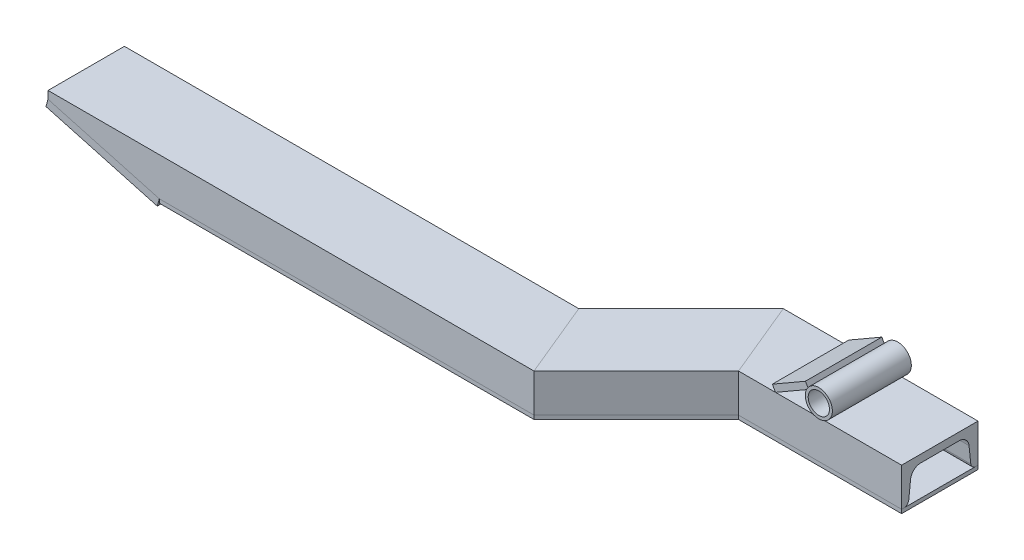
ISO-10303-21;
HEADER;
FILE_DESCRIPTION(('STEP AP214'),'2;1');
FILE_NAME('part.step','',(''),(''),'','','');
FILE_SCHEMA(('AUTOMOTIVE_DESIGN { 1 0 10303 214 1 1 1 1 }'));
ENDSEC;
DATA;
#1=APPLICATION_CONTEXT('core data for automotive mechanical design processes');
#2=APPLICATION_PROTOCOL_DEFINITION('international standard','automotive_design',2000,#1);
#3=PRODUCT_CONTEXT('',#1,'mechanical');
#4=PRODUCT('Part','Part','',(#3));
#5=PRODUCT_RELATED_PRODUCT_CATEGORY('part','',(#4));
#6=PRODUCT_DEFINITION_FORMATION('','',#4);
#7=PRODUCT_DEFINITION_CONTEXT('part definition',#1,'design');
#8=PRODUCT_DEFINITION('design','',#6,#7);
#9=PRODUCT_DEFINITION_SHAPE('','',#8);
#10=(LENGTH_UNIT() NAMED_UNIT(*) SI_UNIT(.MILLI.,.METRE.));
#11=(NAMED_UNIT(*) PLANE_ANGLE_UNIT() SI_UNIT($,.RADIAN.));
#12=(NAMED_UNIT(*) SI_UNIT($,.STERADIAN.) SOLID_ANGLE_UNIT());
#13=UNCERTAINTY_MEASURE_WITH_UNIT(LENGTH_MEASURE(1.E-05),#10,'distance_accuracy_value','');
#14=(GEOMETRIC_REPRESENTATION_CONTEXT(3) GLOBAL_UNCERTAINTY_ASSIGNED_CONTEXT((#13)) GLOBAL_UNIT_ASSIGNED_CONTEXT((#10,
#11,#12)) REPRESENTATION_CONTEXT('',''));
#15=CARTESIAN_POINT('',(0.,0.,0.));
#16=DIRECTION('',(0.,0.,1.));
#17=DIRECTION('',(1.,0.,0.));
#18=AXIS2_PLACEMENT_3D('',#15,#16,#17);
#19=CARTESIAN_POINT('',(-101.5,37.3301270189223,60.));
#20=DIRECTION('',(0.86602540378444,0.499999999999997,0.));
#21=DIRECTION('',(-0.499999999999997,0.86602540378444,0.));
#22=AXIS2_PLACEMENT_3D('',#19,#20,#21);
#23=PLANE('',#22);
#24=DIRECTION('',(0.499999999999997,-0.86602540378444,0.));
#25=VECTOR('',#24,1.);
#26=CARTESIAN_POINT('',(-101.5,37.3301270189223,0.));
#27=LINE('',#26,#25);
#28=CARTESIAN_POINT('',(-101.5,37.3301270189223,0.));
#29=VERTEX_POINT('',#28);
#30=CARTESIAN_POINT('',(-99.0000000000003,33.0000000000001,0.));
#31=VERTEX_POINT('',#30);
#32=EDGE_CURVE('E87',#29,#31,#27,.T.);
#33=ORIENTED_EDGE('',*,*,#32,.T.);
#34=DIRECTION('',(0.,0.,-1.));
#35=VECTOR('',#34,1.);
#36=CARTESIAN_POINT('',(-99.0000000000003,33.0000000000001,60.));
#37=LINE('',#36,#35);
#38=CARTESIAN_POINT('',(-99.0000000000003,33.0000000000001,60.));
#39=VERTEX_POINT('',#38);
#40=EDGE_CURVE('E12',#39,#31,#37,.T.);
#41=ORIENTED_EDGE('',*,*,#40,.F.);
#42=DIRECTION('',(0.499999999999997,-0.86602540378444,0.));
#43=VECTOR('',#42,1.);
#44=CARTESIAN_POINT('',(-101.5,37.3301270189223,60.));
#45=LINE('',#44,#43);
#46=CARTESIAN_POINT('',(-101.5,37.3301270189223,60.));
#47=VERTEX_POINT('',#46);
#48=EDGE_CURVE('E105',#47,#39,#45,.T.);
#49=ORIENTED_EDGE('',*,*,#48,.F.);
#50=DIRECTION('',(0.,0.,-1.));
#51=VECTOR('',#50,1.);
#52=CARTESIAN_POINT('',(-101.5,37.3301270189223,60.));
#53=LINE('',#52,#51);
#54=EDGE_CURVE('E99',#47,#29,#53,.T.);
#55=ORIENTED_EDGE('',*,*,#54,.T.);
#56=EDGE_LOOP('',(#33,#41,#49,#55));
#57=FACE_BOUND('',#56,.T.);
#58=ADVANCED_FACE('F43',(#57),#23,.F.);
#59=CARTESIAN_POINT('',(-99.0000000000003,33.0000000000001,60.));
#60=DIRECTION('',(-0.499999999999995,0.866025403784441,0.));
#61=DIRECTION('',(-0.866025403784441,-0.499999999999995,0.));
#62=AXIS2_PLACEMENT_3D('',#59,#60,#61);
#63=PLANE('',#62);
#64=DIRECTION('',(0.866025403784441,0.499999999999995,0.));
#65=VECTOR('',#64,1.);
#66=CARTESIAN_POINT('',(-99.0000000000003,33.0000000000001,0.));
#67=LINE('',#66,#65);
#68=CARTESIAN_POINT('',(-73.0192378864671,47.9999999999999,0.));
#69=VERTEX_POINT('',#68);
#70=EDGE_CURVE('E83',#31,#69,#67,.T.);
#71=ORIENTED_EDGE('',*,*,#70,.T.);
#72=DIRECTION('',(0.,0.,-1.));
#73=VECTOR('',#72,1.);
#74=CARTESIAN_POINT('',(-73.0192378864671,47.9999999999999,60.));
#75=LINE('',#74,#73);
#76=CARTESIAN_POINT('',(-73.0192378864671,47.9999999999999,60.));
#77=VERTEX_POINT('',#76);
#78=EDGE_CURVE('E50',#77,#69,#75,.T.);
#79=ORIENTED_EDGE('',*,*,#78,.F.);
#80=DIRECTION('',(0.866025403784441,0.499999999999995,0.));
#81=VECTOR('',#80,1.);
#82=CARTESIAN_POINT('',(-99.0000000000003,33.0000000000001,60.));
#83=LINE('',#82,#81);
#84=EDGE_CURVE('E95',#39,#77,#83,.T.);
#85=ORIENTED_EDGE('',*,*,#84,.F.);
#86=ORIENTED_EDGE('',*,*,#40,.T.);
#87=EDGE_LOOP('',(#71,#79,#85,#86));
#88=FACE_BOUND('',#87,.T.);
#89=ADVANCED_FACE('F94',(#88),#63,.F.);
#90=CARTESIAN_POINT('',(-75.5192378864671,52.3301270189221,60.));
#91=DIRECTION('',(-0.866025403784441,-0.499999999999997,0.));
#92=DIRECTION('',(0.499999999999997,-0.866025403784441,0.));
#93=AXIS2_PLACEMENT_3D('',#90,#91,#92);
#94=PLANE('',#93);
#95=DIRECTION('',(-0.499999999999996,0.866025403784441,0.));
#96=VECTOR('',#95,1.);
#97=CARTESIAN_POINT('',(-75.5192378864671,52.3301270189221,0.));
#98=LINE('',#97,#96);
#99=CARTESIAN_POINT('',(-75.5192378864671,52.3301270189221,0.));
#100=VERTEX_POINT('',#99);
#101=EDGE_CURVE('E88',#69,#100,#98,.T.);
#102=ORIENTED_EDGE('',*,*,#101,.T.);
#103=DIRECTION('',(0.,0.,-1.));
#104=VECTOR('',#103,1.);
#105=CARTESIAN_POINT('',(-75.5192378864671,52.3301270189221,60.));
#106=LINE('',#105,#104);
#107=CARTESIAN_POINT('',(-75.5192378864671,52.3301270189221,60.));
#108=VERTEX_POINT('',#107);
#109=EDGE_CURVE('E111',#108,#100,#106,.T.);
#110=ORIENTED_EDGE('',*,*,#109,.F.);
#111=DIRECTION('',(-0.499999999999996,0.866025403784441,0.));
#112=VECTOR('',#111,1.);
#113=CARTESIAN_POINT('',(-75.5192378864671,52.3301270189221,60.));
#114=LINE('',#113,#112);
#115=EDGE_CURVE('E62',#77,#108,#114,.T.);
#116=ORIENTED_EDGE('',*,*,#115,.F.);
#117=ORIENTED_EDGE('',*,*,#78,.T.);
#118=EDGE_LOOP('',(#102,#110,#116,#117));
#119=FACE_BOUND('',#118,.T.);
#120=ADVANCED_FACE('F114',(#119),#94,.F.);
#121=CARTESIAN_POINT('',(-101.5,37.3301270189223,60.));
#122=DIRECTION('',(0.499999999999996,-0.866025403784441,0.));
#123=DIRECTION('',(0.866025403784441,0.499999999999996,0.));
#124=AXIS2_PLACEMENT_3D('',#121,#122,#123);
#125=PLANE('',#124);
#126=DIRECTION('',(-0.866025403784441,-0.499999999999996,0.));
#127=VECTOR('',#126,1.);
#128=CARTESIAN_POINT('',(-101.5,37.3301270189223,0.));
#129=LINE('',#128,#127);
#130=EDGE_CURVE('E103',#100,#29,#129,.T.);
#131=ORIENTED_EDGE('',*,*,#130,.T.);
#132=ORIENTED_EDGE('',*,*,#54,.F.);
#133=DIRECTION('',(-0.866025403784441,-0.499999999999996,0.));
#134=VECTOR('',#133,1.);
#135=CARTESIAN_POINT('',(-101.5,37.3301270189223,60.));
#136=LINE('',#135,#134);
#137=EDGE_CURVE('E57',#108,#47,#136,.T.);
#138=ORIENTED_EDGE('',*,*,#137,.F.);
#139=ORIENTED_EDGE('',*,*,#109,.T.);
#140=EDGE_LOOP('',(#131,#132,#138,#139));
#141=FACE_BOUND('',#140,.T.);
#142=ADVANCED_FACE('F116',(#141),#125,.F.);
#143=CARTESIAN_POINT('',(-101.5,37.3301270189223,60.));
#144=DIRECTION('',(0.,0.,1.));
#145=DIRECTION('',(1.,0.,0.));
#146=AXIS2_PLACEMENT_3D('',#143,#144,#145);
#147=PLANE('',#146);
#148=ORIENTED_EDGE('',*,*,#48,.T.);
#149=ORIENTED_EDGE('',*,*,#84,.T.);
#150=ORIENTED_EDGE('',*,*,#115,.T.);
#151=ORIENTED_EDGE('',*,*,#137,.T.);
#152=EDGE_LOOP('',(#148,#149,#150,#151));
#153=FACE_BOUND('',#152,.T.);
#154=ADVANCED_FACE('F117',(#153),#147,.T.);
#155=CARTESIAN_POINT('',(-101.5,37.3301270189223,0.));
#156=DIRECTION('',(0.,0.,1.));
#157=DIRECTION('',(1.,0.,0.));
#158=AXIS2_PLACEMENT_3D('',#155,#156,#157);
#159=PLANE('',#158);
#160=ORIENTED_EDGE('',*,*,#32,.F.);
#161=ORIENTED_EDGE('',*,*,#130,.F.);
#162=ORIENTED_EDGE('',*,*,#101,.F.);
#163=ORIENTED_EDGE('',*,*,#70,.F.);
#164=EDGE_LOOP('',(#160,#161,#162,#163));
#165=FACE_BOUND('',#164,.T.);
#166=ADVANCED_FACE('F84',(#165),#159,.F.);
#167=CLOSED_SHELL('',(#58,#89,#120,#142,#154,#166));
#168=MANIFOLD_SOLID_BREP('B2',#167);
#169=CARTESIAN_POINT('',(-64.,43.65,61.));
#170=DIRECTION('',(0.,0.,-1.));
#171=DIRECTION('',(-1.,0.,0.));
#172=AXIS2_PLACEMENT_3D('',#169,#170,#171);
#173=CYLINDRICAL_SURFACE('',#172,8.35);
#174=CARTESIAN_POINT('',(-64.,43.65,61.));
#175=DIRECTION('',(0.,0.,1.));
#176=DIRECTION('',(1.,0.,0.));
#177=AXIS2_PLACEMENT_3D('',#174,#175,#176);
#178=CIRCLE('',#177,8.35);
#179=CARTESIAN_POINT('',(-55.65,43.65,61.));
#180=VERTEX_POINT('',#179);
#181=EDGE_CURVE('E194',#180,#180,#178,.T.);
#182=ORIENTED_EDGE('',*,*,#181,.T.);
#183=EDGE_LOOP('',(#182));
#184=FACE_BOUND('',#183,.T.);
#185=CARTESIAN_POINT('',(-64.,43.65,-0.999999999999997));
#186=DIRECTION('',(0.,0.,1.));
#187=DIRECTION('',(1.,0.,0.));
#188=AXIS2_PLACEMENT_3D('',#185,#186,#187);
#189=CIRCLE('',#188,8.35);
#190=CARTESIAN_POINT('',(-55.65,43.65,-0.999999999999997));
#191=VERTEX_POINT('',#190);
#192=EDGE_CURVE('E202',#191,#191,#189,.T.);
#193=ORIENTED_EDGE('',*,*,#192,.F.);
#194=EDGE_LOOP('',(#193));
#195=FACE_BOUND('',#194,.T.);
#196=ADVANCED_FACE('F188',(#184,#195),#173,.F.);
#197=CARTESIAN_POINT('',(-64.,43.65,61.));
#198=DIRECTION('',(0.,0.,-1.));
#199=DIRECTION('',(-1.,0.,0.));
#200=AXIS2_PLACEMENT_3D('',#197,#198,#199);
#201=CYLINDRICAL_SURFACE('',#200,10.65);
#202=CARTESIAN_POINT('',(-64.,43.65,61.));
#203=DIRECTION('',(0.,0.,1.));
#204=DIRECTION('',(1.,0.,0.));
#205=AXIS2_PLACEMENT_3D('',#202,#203,#204);
#206=CIRCLE('',#205,10.65);
#207=CARTESIAN_POINT('',(-53.35,43.65,61.));
#208=VERTEX_POINT('',#207);
#209=EDGE_CURVE('E42',#208,#208,#206,.T.);
#210=ORIENTED_EDGE('',*,*,#209,.F.);
#211=EDGE_LOOP('',(#210));
#212=FACE_BOUND('',#211,.T.);
#213=CARTESIAN_POINT('',(-64.,43.65,-0.999999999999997));
#214=DIRECTION('',(0.,0.,1.));
#215=DIRECTION('',(1.,0.,0.));
#216=AXIS2_PLACEMENT_3D('',#213,#214,#215);
#217=CIRCLE('',#216,10.65);
#218=CARTESIAN_POINT('',(-53.35,43.65,-0.999999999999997));
#219=VERTEX_POINT('',#218);
#220=EDGE_CURVE('E198',#219,#219,#217,.T.);
#221=ORIENTED_EDGE('',*,*,#220,.T.);
#222=EDGE_LOOP('',(#221));
#223=FACE_BOUND('',#222,.T.);
#224=ADVANCED_FACE('F212',(#212,#223),#201,.T.);
#225=CARTESIAN_POINT('',(-64.,43.65,61.));
#226=DIRECTION('',(0.,0.,1.));
#227=DIRECTION('',(1.,0.,0.));
#228=AXIS2_PLACEMENT_3D('',#225,#226,#227);
#229=PLANE('',#228);
#230=ORIENTED_EDGE('',*,*,#181,.F.);
#231=EDGE_LOOP('',(#230));
#232=FACE_BOUND('',#231,.T.);
#233=ORIENTED_EDGE('',*,*,#209,.T.);
#234=EDGE_LOOP('',(#233));
#235=FACE_BOUND('',#234,.T.);
#236=ADVANCED_FACE('F216',(#232,#235),#229,.T.);
#237=CARTESIAN_POINT('',(-64.,43.65,-0.999999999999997));
#238=DIRECTION('',(0.,0.,1.));
#239=DIRECTION('',(1.,0.,0.));
#240=AXIS2_PLACEMENT_3D('',#237,#238,#239);
#241=PLANE('',#240);
#242=ORIENTED_EDGE('',*,*,#192,.T.);
#243=EDGE_LOOP('',(#242));
#244=FACE_BOUND('',#243,.T.);
#245=ORIENTED_EDGE('',*,*,#220,.F.);
#246=EDGE_LOOP('',(#245));
#247=FACE_BOUND('',#246,.T.);
#248=ADVANCED_FACE('F208',(#244,#247),#241,.F.);
#249=CLOSED_SHELL('',(#196,#224,#236,#248));
#250=MANIFOLD_SOLID_BREP('B6',#249);
#251=CARTESIAN_POINT('',(-502.6,3.,140.3));
#252=DIRECTION('',(0.,0.,-1.));
#253=DIRECTION('',(-1.,0.,0.));
#254=AXIS2_PLACEMENT_3D('',#251,#252,#253);
#255=PLANE('',#254);
#256=DIRECTION('',(-0.264797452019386,-0.96430405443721,0.));
#257=VECTOR('',#256,1.);
#258=CARTESIAN_POINT('',(-590.,27.,140.3));
#259=LINE('',#258,#257);
#260=CARTESIAN_POINT('',(-590.,27.,140.3));
#261=VERTEX_POINT('',#260);
#262=CARTESIAN_POINT('',(-591.588784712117,21.2141756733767,140.3));
#263=VERTEX_POINT('',#262);
#264=EDGE_CURVE('E311',#261,#263,#259,.T.);
#265=ORIENTED_EDGE('',*,*,#264,.T.);
#266=DIRECTION('',(-0.964304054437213,0.264797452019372,0.));
#267=VECTOR('',#266,1.);
#268=CARTESIAN_POINT('',(-504.188784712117,-2.78582432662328,140.3));
#269=LINE('',#268,#267);
#270=CARTESIAN_POINT('',(-504.188784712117,-2.78582432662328,140.3));
#271=VERTEX_POINT('',#270);
#272=EDGE_CURVE('E186',#271,#263,#269,.T.);
#273=ORIENTED_EDGE('',*,*,#272,.F.);
#274=DIRECTION('',(-0.264797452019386,-0.96430405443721,0.));
#275=VECTOR('',#274,1.);
#276=CARTESIAN_POINT('',(-502.6,3.,140.3));
#277=LINE('',#276,#275);
#278=CARTESIAN_POINT('',(-502.6,3.,140.3));
#279=VERTEX_POINT('',#278);
#280=EDGE_CURVE('E329',#279,#271,#277,.T.);
#281=ORIENTED_EDGE('',*,*,#280,.F.);
#282=DIRECTION('',(-0.964304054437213,0.264797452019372,0.));
#283=VECTOR('',#282,1.);
#284=CARTESIAN_POINT('',(-502.6,3.,140.3));
#285=LINE('',#284,#283);
#286=EDGE_CURVE('E323',#279,#261,#285,.T.);
#287=ORIENTED_EDGE('',*,*,#286,.T.);
#288=EDGE_LOOP('',(#265,#273,#281,#287));
#289=FACE_BOUND('',#288,.T.);
#290=ADVANCED_FACE('F267',(#289),#255,.F.);
#291=CARTESIAN_POINT('',(-504.188784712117,-2.78582432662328,140.3));
#292=DIRECTION('',(0.264797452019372,0.964304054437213,0.));
#293=DIRECTION('',(-0.964304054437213,0.264797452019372,0.));
#294=AXIS2_PLACEMENT_3D('',#291,#292,#293);
#295=PLANE('',#294);
#296=DIRECTION('',(0.,0.,-1.));
#297=VECTOR('',#296,1.);
#298=CARTESIAN_POINT('',(-591.588784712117,21.2141756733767,140.3));
#299=LINE('',#298,#297);
#300=CARTESIAN_POINT('',(-591.588784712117,21.2141756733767,80.3000000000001));
#301=VERTEX_POINT('',#300);
#302=EDGE_CURVE('E307',#263,#301,#299,.T.);
#303=ORIENTED_EDGE('',*,*,#302,.T.);
#304=DIRECTION('',(-0.964304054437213,0.264797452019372,0.));
#305=VECTOR('',#304,1.);
#306=CARTESIAN_POINT('',(-504.188784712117,-2.78582432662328,80.3000000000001));
#307=LINE('',#306,#305);
#308=CARTESIAN_POINT('',(-504.188784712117,-2.78582432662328,80.3000000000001));
#309=VERTEX_POINT('',#308);
#310=EDGE_CURVE('E274',#309,#301,#307,.T.);
#311=ORIENTED_EDGE('',*,*,#310,.F.);
#312=DIRECTION('',(0.,0.,-1.));
#313=VECTOR('',#312,1.);
#314=CARTESIAN_POINT('',(-504.188784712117,-2.78582432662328,140.3));
#315=LINE('',#314,#313);
#316=EDGE_CURVE('E319',#271,#309,#315,.T.);
#317=ORIENTED_EDGE('',*,*,#316,.F.);
#318=ORIENTED_EDGE('',*,*,#272,.T.);
#319=EDGE_LOOP('',(#303,#311,#317,#318));
#320=FACE_BOUND('',#319,.T.);
#321=ADVANCED_FACE('F318',(#320),#295,.F.);
#322=CARTESIAN_POINT('',(-502.6,3.,80.3000000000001));
#323=DIRECTION('',(0.,0.,1.));
#324=DIRECTION('',(1.,0.,0.));
#325=AXIS2_PLACEMENT_3D('',#322,#323,#324);
#326=PLANE('',#325);
#327=DIRECTION('',(0.264797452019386,0.96430405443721,0.));
#328=VECTOR('',#327,1.);
#329=CARTESIAN_POINT('',(-590.,27.,80.3000000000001));
#330=LINE('',#329,#328);
#331=CARTESIAN_POINT('',(-590.,27.,80.3000000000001));
#332=VERTEX_POINT('',#331);
#333=EDGE_CURVE('E312',#301,#332,#330,.T.);
#334=ORIENTED_EDGE('',*,*,#333,.T.);
#335=DIRECTION('',(-0.964304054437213,0.264797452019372,0.));
#336=VECTOR('',#335,1.);
#337=CARTESIAN_POINT('',(-502.6,3.,80.3000000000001));
#338=LINE('',#337,#336);
#339=CARTESIAN_POINT('',(-502.6,3.,80.3000000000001));
#340=VERTEX_POINT('',#339);
#341=EDGE_CURVE('E335',#340,#332,#338,.T.);
#342=ORIENTED_EDGE('',*,*,#341,.F.);
#343=DIRECTION('',(0.264797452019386,0.96430405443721,0.));
#344=VECTOR('',#343,1.);
#345=CARTESIAN_POINT('',(-502.6,3.,80.3000000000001));
#346=LINE('',#345,#344);
#347=EDGE_CURVE('E286',#309,#340,#346,.T.);
#348=ORIENTED_EDGE('',*,*,#347,.F.);
#349=ORIENTED_EDGE('',*,*,#310,.T.);
#350=EDGE_LOOP('',(#334,#342,#348,#349));
#351=FACE_BOUND('',#350,.T.);
#352=ADVANCED_FACE('F338',(#351),#326,.F.);
#353=CARTESIAN_POINT('',(-502.6,3.,140.3));
#354=DIRECTION('',(-0.264797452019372,-0.964304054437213,0.));
#355=DIRECTION('',(0.964304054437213,-0.264797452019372,0.));
#356=AXIS2_PLACEMENT_3D('',#353,#354,#355);
#357=PLANE('',#356);
#358=DIRECTION('',(0.,0.,1.));
#359=VECTOR('',#358,1.);
#360=CARTESIAN_POINT('',(-590.,27.,140.3));
#361=LINE('',#360,#359);
#362=EDGE_CURVE('E327',#332,#261,#361,.T.);
#363=ORIENTED_EDGE('',*,*,#362,.T.);
#364=ORIENTED_EDGE('',*,*,#286,.F.);
#365=DIRECTION('',(0.,0.,1.));
#366=VECTOR('',#365,1.);
#367=CARTESIAN_POINT('',(-502.6,3.,140.3));
#368=LINE('',#367,#366);
#369=EDGE_CURVE('E281',#340,#279,#368,.T.);
#370=ORIENTED_EDGE('',*,*,#369,.F.);
#371=ORIENTED_EDGE('',*,*,#341,.T.);
#372=EDGE_LOOP('',(#363,#364,#370,#371));
#373=FACE_BOUND('',#372,.T.);
#374=ADVANCED_FACE('F340',(#373),#357,.F.);
#375=CARTESIAN_POINT('',(-504.188784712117,-2.78582432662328,140.3));
#376=DIRECTION('',(0.96430405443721,-0.264797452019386,0.));
#377=DIRECTION('',(0.264797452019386,0.96430405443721,0.));
#378=AXIS2_PLACEMENT_3D('',#375,#376,#377);
#379=PLANE('',#378);
#380=ORIENTED_EDGE('',*,*,#280,.T.);
#381=ORIENTED_EDGE('',*,*,#316,.T.);
#382=ORIENTED_EDGE('',*,*,#347,.T.);
#383=ORIENTED_EDGE('',*,*,#369,.T.);
#384=EDGE_LOOP('',(#380,#381,#382,#383));
#385=FACE_BOUND('',#384,.T.);
#386=ADVANCED_FACE('F341',(#385),#379,.T.);
#387=CARTESIAN_POINT('',(-591.588784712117,21.2141756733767,140.3));
#388=DIRECTION('',(0.96430405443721,-0.264797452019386,0.));
#389=DIRECTION('',(0.264797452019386,0.96430405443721,0.));
#390=AXIS2_PLACEMENT_3D('',#387,#388,#389);
#391=PLANE('',#390);
#392=ORIENTED_EDGE('',*,*,#264,.F.);
#393=ORIENTED_EDGE('',*,*,#362,.F.);
#394=ORIENTED_EDGE('',*,*,#333,.F.);
#395=ORIENTED_EDGE('',*,*,#302,.F.);
#396=EDGE_LOOP('',(#392,#393,#394,#395));
#397=FACE_BOUND('',#396,.T.);
#398=ADVANCED_FACE('F308',(#397),#391,.F.);
#399=CLOSED_SHELL('',(#290,#321,#352,#374,#386,#398));
#400=MANIFOLD_SOLID_BREP('B37',#399);
#401=CARTESIAN_POINT('',(-195.754329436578,19.8362277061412,117.745670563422));
#402=DIRECTION('',(0.703233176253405,0.104528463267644,0.703233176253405));
#403=DIRECTION('',(0.707106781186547,0.,-0.707106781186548));
#404=AXIS2_PLACEMENT_3D('',#401,#402,#403);
#405=PLANE('',#404);
#406=DIRECTION('',(0.0432565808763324,-0.993591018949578,0.10443062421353));
#407=VECTOR('',#406,1.);
#408=CARTESIAN_POINT('',(-211.305877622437,20.7789868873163,133.157087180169));
#409=LINE('',#408,#407);
#410=CARTESIAN_POINT('',(-211.264834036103,19.8362277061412,133.256175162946));
#411=VERTEX_POINT('',#410);
#412=CARTESIAN_POINT('',(-210.687798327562,6.58188614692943,134.649262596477));
#413=VERTEX_POINT('',#412);
#414=EDGE_CURVE('E501',#411,#413,#409,.T.);
#415=ORIENTED_EDGE('',*,*,#414,.F.);
#416=DIRECTION('',(0.707106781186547,0.,-0.707106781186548));
#417=VECTOR('',#416,1.);
#418=CARTESIAN_POINT('',(-195.754329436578,19.8362277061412,117.745670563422));
#419=LINE('',#418,#417);
#420=CARTESIAN_POINT('',(-130.964834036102,19.8362277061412,52.9561751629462));
#421=VERTEX_POINT('',#420);
#422=EDGE_CURVE('E569',#411,#421,#419,.T.);
#423=ORIENTED_EDGE('',*,*,#422,.T.);
#424=DIRECTION('',(0.0432565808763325,-0.993591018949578,0.10443062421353));
#425=VECTOR('',#424,1.);
#426=CARTESIAN_POINT('',(-130.793389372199,15.8981938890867,53.370079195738));
#427=LINE('',#426,#425);
#428=CARTESIAN_POINT('',(-130.387798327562,6.58188614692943,54.3492625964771));
#429=VERTEX_POINT('',#428);
#430=EDGE_CURVE('E504',#421,#429,#427,.T.);
#431=ORIENTED_EDGE('',*,*,#430,.T.);
#432=DIRECTION('',(0.707106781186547,0.,-0.707106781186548));
#433=VECTOR('',#432,1.);
#434=CARTESIAN_POINT('',(-194.769267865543,6.58188614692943,118.730732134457));
#435=LINE('',#434,#433);
#436=EDGE_CURVE('E416',#413,#429,#435,.T.);
#437=ORIENTED_EDGE('',*,*,#436,.F.);
#438=EDGE_LOOP('',(#415,#423,#431,#437));
#439=FACE_BOUND('',#438,.T.);
#440=ADVANCED_FACE('F412',(#439),#405,.F.);
#441=CARTESIAN_POINT('',(-201.380194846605,19.,112.119805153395));
#442=DIRECTION('',(0.707106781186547,0.,-0.707106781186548));
#443=DIRECTION('',(-0.707106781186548,0.,-0.707106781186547));
#444=AXIS2_PLACEMENT_3D('',#441,#442,#443);
#445=CYLINDRICAL_SURFACE('',#444,8.);
#446=CARTESIAN_POINT('',(-214.560389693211,19.,125.3));
#447=DIRECTION('',(-0.923879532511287,0.,0.38268343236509));
#448=DIRECTION('',(-0.38268343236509,0.,-0.923879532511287));
#449=AXIS2_PLACEMENT_3D('',#446,#447,#448);
#450=ELLIPSE('',#449,8.65913760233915,8.);
#451=CARTESIAN_POINT('',(-214.560389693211,27.,125.3));
#452=VERTEX_POINT('',#451);
#453=EDGE_CURVE('E515',#452,#411,#450,.F.);
#454=ORIENTED_EDGE('',*,*,#453,.F.);
#455=DIRECTION('',(0.707106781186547,0.,-0.707106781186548));
#456=VECTOR('',#455,1.);
#457=CARTESIAN_POINT('',(-201.380194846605,27.,112.119805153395));
#458=LINE('',#457,#456);
#459=CARTESIAN_POINT('',(-134.260389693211,27.,45.));
#460=VERTEX_POINT('',#459);
#461=EDGE_CURVE('E568',#452,#460,#458,.T.);
#462=ORIENTED_EDGE('',*,*,#461,.T.);
#463=CARTESIAN_POINT('',(-134.260389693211,19.,45.));
#464=DIRECTION('',(-0.923879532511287,0.,0.38268343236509));
#465=DIRECTION('',(-0.38268343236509,0.,-0.923879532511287));
#466=AXIS2_PLACEMENT_3D('',#463,#464,#465);
#467=ELLIPSE('',#466,8.65913760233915,8.);
#468=EDGE_CURVE('E519',#460,#421,#467,.F.);
#469=ORIENTED_EDGE('',*,*,#468,.T.);
#470=ORIENTED_EDGE('',*,*,#422,.F.);
#471=EDGE_LOOP('',(#454,#462,#469,#470));
#472=FACE_BOUND('',#471,.T.);
#473=ADVANCED_FACE('F630',(#472),#445,.F.);
#474=CARTESIAN_POINT('',(-201.380194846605,27.,112.119805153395));
#475=DIRECTION('',(0.,1.,0.));
#476=DIRECTION('',(0.,0.,1.));
#477=AXIS2_PLACEMENT_3D('',#474,#475,#476);
#478=PLANE('',#477);
#479=DIRECTION('',(0.38268343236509,0.,0.923879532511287));
#480=VECTOR('',#479,1.);
#481=CARTESIAN_POINT('',(-217.290097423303,27.,118.709902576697));
#482=LINE('',#481,#480);
#483=CARTESIAN_POINT('',(-226.986796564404,27.,95.3000000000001));
#484=VERTEX_POINT('',#483);
#485=EDGE_CURVE('E265',#484,#452,#482,.T.);
#486=ORIENTED_EDGE('',*,*,#485,.F.);
#487=DIRECTION('',(0.707106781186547,0.,-0.707106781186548));
#488=VECTOR('',#487,1.);
#489=CARTESIAN_POINT('',(-222.593398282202,27.,90.9066017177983));
#490=LINE('',#489,#488);
#491=CARTESIAN_POINT('',(-146.686796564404,27.,15.));
#492=VERTEX_POINT('',#491);
#493=EDGE_CURVE('E566',#484,#492,#490,.T.);
#494=ORIENTED_EDGE('',*,*,#493,.T.);
#495=DIRECTION('',(0.38268343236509,0.,0.923879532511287));
#496=VECTOR('',#495,1.);
#497=CARTESIAN_POINT('',(-120.359422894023,27.,78.5599025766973));
#498=LINE('',#497,#496);
#499=EDGE_CURVE('E565',#492,#460,#498,.T.);
#500=ORIENTED_EDGE('',*,*,#499,.T.);
#501=ORIENTED_EDGE('',*,*,#461,.F.);
#502=EDGE_LOOP('',(#486,#494,#500,#501));
#503=FACE_BOUND('',#502,.T.);
#504=ADVANCED_FACE('F592',(#503),#478,.F.);
#505=CARTESIAN_POINT('',(-222.593398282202,19.,90.9066017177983));
#506=DIRECTION('',(0.707106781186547,0.,-0.707106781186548));
#507=DIRECTION('',(-0.707106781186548,0.,-0.707106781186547));
#508=AXIS2_PLACEMENT_3D('',#505,#506,#507);
#509=CYLINDRICAL_SURFACE('',#508,8.);
#510=CARTESIAN_POINT('',(-226.986796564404,19.,95.3000000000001));
#511=DIRECTION('',(-0.923879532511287,0.,0.38268343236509));
#512=DIRECTION('',(-0.38268343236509,0.,-0.923879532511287));
#513=AXIS2_PLACEMENT_3D('',#510,#511,#512);
#514=ELLIPSE('',#513,8.65913760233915,8.);
#515=CARTESIAN_POINT('',(-230.282352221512,19.8362277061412,87.3438248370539));
#516=VERTEX_POINT('',#515);
#517=EDGE_CURVE('E421',#516,#484,#514,.F.);
#518=ORIENTED_EDGE('',*,*,#517,.F.);
#519=DIRECTION('',(0.707106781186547,0.,-0.707106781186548));
#520=VECTOR('',#519,1.);
#521=CARTESIAN_POINT('',(-228.219263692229,19.8362277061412,85.2807363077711));
#522=LINE('',#521,#520);
#523=CARTESIAN_POINT('',(-149.982352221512,19.8362277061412,7.04382483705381));
#524=VERTEX_POINT('',#523);
#525=EDGE_CURVE('E563',#516,#524,#522,.T.);
#526=ORIENTED_EDGE('',*,*,#525,.T.);
#527=CARTESIAN_POINT('',(-146.686796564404,19.,15.));
#528=DIRECTION('',(-0.923879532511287,0.,0.38268343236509));
#529=DIRECTION('',(-0.38268343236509,0.,-0.923879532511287));
#530=AXIS2_PLACEMENT_3D('',#527,#528,#529);
#531=ELLIPSE('',#530,8.65913760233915,8.);
#532=EDGE_CURVE('E562',#524,#492,#531,.F.);
#533=ORIENTED_EDGE('',*,*,#532,.T.);
#534=ORIENTED_EDGE('',*,*,#493,.F.);
#535=EDGE_LOOP('',(#518,#526,#533,#534));
#536=FACE_BOUND('',#535,.T.);
#537=ADVANCED_FACE('F601',(#536),#509,.F.);
#538=CARTESIAN_POINT('',(-228.219263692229,19.8362277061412,85.2807363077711));
#539=DIRECTION('',(-0.703233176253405,0.104528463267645,-0.703233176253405));
#540=DIRECTION('',(-0.707106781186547,0.,0.707106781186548));
#541=AXIS2_PLACEMENT_3D('',#538,#539,#540);
#542=PLANE('',#541);
#543=DIRECTION('',(0.0432565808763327,0.993591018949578,0.104430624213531));
#544=VECTOR('',#543,1.);
#545=CARTESIAN_POINT('',(-230.28781152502,19.7108291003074,87.3306449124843));
#546=LINE('',#545,#544);
#547=CARTESIAN_POINT('',(-230.859387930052,6.58188614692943,85.950737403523));
#548=VERTEX_POINT('',#547);
#549=EDGE_CURVE('E524',#548,#516,#546,.T.);
#550=ORIENTED_EDGE('',*,*,#549,.F.);
#551=DIRECTION('',(0.707106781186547,0.,-0.707106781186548));
#552=VECTOR('',#551,1.);
#553=CARTESIAN_POINT('',(-229.204325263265,6.58188614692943,84.2956747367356));
#554=LINE('',#553,#552);
#555=CARTESIAN_POINT('',(-150.559387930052,6.58188614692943,5.65073740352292));
#556=VERTEX_POINT('',#555);
#557=EDGE_CURVE('E560',#548,#556,#554,.T.);
#558=ORIENTED_EDGE('',*,*,#557,.T.);
#559=DIRECTION('',(0.0432565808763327,0.993591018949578,0.104430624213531));
#560=VECTOR('',#559,1.);
#561=CARTESIAN_POINT('',(-149.775323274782,24.591622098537,7.54363692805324));
#562=LINE('',#561,#560);
#563=EDGE_CURVE('E559',#556,#524,#562,.T.);
#564=ORIENTED_EDGE('',*,*,#563,.T.);
#565=ORIENTED_EDGE('',*,*,#525,.F.);
#566=EDGE_LOOP('',(#550,#558,#564,#565));
#567=FACE_BOUND('',#566,.T.);
#568=ADVANCED_FACE('F604',(#567),#542,.F.);
#569=CARTESIAN_POINT('',(-232.017257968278,7.,81.482742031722));
#570=DIRECTION('',(0.707106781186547,0.,-0.707106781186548));
#571=DIRECTION('',(-0.707106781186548,0.,-0.707106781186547));
#572=AXIS2_PLACEMENT_3D('',#569,#570,#571);
#573=CYLINDRICAL_SURFACE('',#572,4.);
#574=CARTESIAN_POINT('',(-232.507165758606,7.,81.9726498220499));
#575=DIRECTION('',(-0.923879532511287,0.,0.38268343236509));
#576=DIRECTION('',(-0.38268343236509,0.,-0.923879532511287));
#577=AXIS2_PLACEMENT_3D('',#574,#575,#576);
#578=ELLIPSE('',#577,4.32956880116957,4.);
#579=CARTESIAN_POINT('',(-232.507165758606,3.00000000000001,81.9726498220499));
#580=VERTEX_POINT('',#579);
#581=EDGE_CURVE('E527',#580,#548,#578,.T.);
#582=ORIENTED_EDGE('',*,*,#581,.F.);
#583=DIRECTION('',(0.707106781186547,0.,-0.707106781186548));
#584=VECTOR('',#583,1.);
#585=CARTESIAN_POINT('',(-232.017257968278,3.,81.482742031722));
#586=LINE('',#585,#584);
#587=CARTESIAN_POINT('',(-152.207165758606,3.,1.67264982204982));
#588=VERTEX_POINT('',#587);
#589=EDGE_CURVE('E557',#580,#588,#586,.T.);
#590=ORIENTED_EDGE('',*,*,#589,.T.);
#591=CARTESIAN_POINT('',(-152.207165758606,7.,1.6726498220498));
#592=DIRECTION('',(-0.923879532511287,0.,0.38268343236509));
#593=DIRECTION('',(-0.38268343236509,0.,-0.923879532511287));
#594=AXIS2_PLACEMENT_3D('',#591,#592,#593);
#595=ELLIPSE('',#594,4.32956880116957,4.);
#596=EDGE_CURVE('E556',#588,#556,#595,.T.);
#597=ORIENTED_EDGE('',*,*,#596,.T.);
#598=ORIENTED_EDGE('',*,*,#557,.F.);
#599=EDGE_LOOP('',(#582,#590,#597,#598));
#600=FACE_BOUND('',#599,.T.);
#601=ADVANCED_FACE('F608',(#600),#573,.T.);
#602=CARTESIAN_POINT('',(-233.2,3.,80.3000000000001));
#603=DIRECTION('',(0.,1.,0.));
#604=DIRECTION('',(-1.,0.,0.));
#605=AXIS2_PLACEMENT_3D('',#602,#603,#604);
#606=PLANE('',#605);
#607=DIRECTION('',(0.38268343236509,0.,0.923879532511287));
#608=VECTOR('',#607,1.);
#609=CARTESIAN_POINT('',(-233.2,3.,80.3000000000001));
#610=LINE('',#609,#608);
#611=CARTESIAN_POINT('',(-233.2,3.,80.3000000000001));
#612=VERTEX_POINT('',#611);
#613=EDGE_CURVE('E530',#612,#580,#610,.T.);
#614=ORIENTED_EDGE('',*,*,#613,.F.);
#615=DIRECTION('',(0.707106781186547,0.,-0.707106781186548));
#616=VECTOR('',#615,1.);
#617=CARTESIAN_POINT('',(-233.2,3.,80.3000000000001));
#618=LINE('',#617,#616);
#619=CARTESIAN_POINT('',(-152.9,3.,0.));
#620=VERTEX_POINT('',#619);
#621=EDGE_CURVE('E554',#612,#620,#618,.T.);
#622=ORIENTED_EDGE('',*,*,#621,.T.);
#623=DIRECTION('',(0.38268343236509,0.,0.923879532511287));
#624=VECTOR('',#623,1.);
#625=CARTESIAN_POINT('',(-136.26932547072,3.00000000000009,40.15));
#626=LINE('',#625,#624);
#627=EDGE_CURVE('E553',#620,#588,#626,.T.);
#628=ORIENTED_EDGE('',*,*,#627,.T.);
#629=ORIENTED_EDGE('',*,*,#589,.F.);
#630=EDGE_LOOP('',(#614,#622,#628,#629));
#631=FACE_BOUND('',#630,.T.);
#632=ADVANCED_FACE('F611',(#631),#606,.F.);
#633=CARTESIAN_POINT('',(-233.2,3.,80.3000000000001));
#634=DIRECTION('',(0.707106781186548,0.,0.707106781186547));
#635=DIRECTION('',(0.707106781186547,0.,-0.707106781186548));
#636=AXIS2_PLACEMENT_3D('',#633,#634,#635);
#637=PLANE('',#636);
#638=DIRECTION('',(0.,-1.,0.));
#639=VECTOR('',#638,1.);
#640=CARTESIAN_POINT('',(-233.2,3.,80.3000000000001));
#641=LINE('',#640,#639);
#642=CARTESIAN_POINT('',(-233.2,33.,80.3000000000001));
#643=VERTEX_POINT('',#642);
#644=EDGE_CURVE('E533',#643,#612,#641,.T.);
#645=ORIENTED_EDGE('',*,*,#644,.F.);
#646=DIRECTION('',(0.707106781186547,0.,-0.707106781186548));
#647=VECTOR('',#646,1.);
#648=CARTESIAN_POINT('',(-233.2,33.,80.3000000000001));
#649=LINE('',#648,#647);
#650=CARTESIAN_POINT('',(-152.9,33.,0.));
#651=VERTEX_POINT('',#650);
#652=EDGE_CURVE('E551',#643,#651,#649,.T.);
#653=ORIENTED_EDGE('',*,*,#652,.T.);
#654=DIRECTION('',(0.,-1.,0.));
#655=VECTOR('',#654,1.);
#656=CARTESIAN_POINT('',(-152.9,3.00000000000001,0.));
#657=LINE('',#656,#655);
#658=EDGE_CURVE('E550',#651,#620,#657,.T.);
#659=ORIENTED_EDGE('',*,*,#658,.T.);
#660=ORIENTED_EDGE('',*,*,#621,.F.);
#661=EDGE_LOOP('',(#645,#653,#659,#660));
#662=FACE_BOUND('',#661,.T.);
#663=ADVANCED_FACE('F617',(#662),#637,.F.);
#664=CARTESIAN_POINT('',(-190.773593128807,33.,122.726406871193));
#665=DIRECTION('',(0.,-1.,0.));
#666=DIRECTION('',(0.,0.,-1.));
#667=AXIS2_PLACEMENT_3D('',#664,#665,#666);
#668=PLANE('',#667);
#669=DIRECTION('',(-0.38268343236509,0.,-0.923879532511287));
#670=VECTOR('',#669,1.);
#671=CARTESIAN_POINT('',(-211.986796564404,33.,131.513203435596));
#672=LINE('',#671,#670);
#673=CARTESIAN_POINT('',(-208.347186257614,33.,140.3));
#674=VERTEX_POINT('',#673);
#675=EDGE_CURVE('E536',#674,#643,#672,.T.);
#676=ORIENTED_EDGE('',*,*,#675,.F.);
#677=DIRECTION('',(0.707106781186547,0.,-0.707106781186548));
#678=VECTOR('',#677,1.);
#679=CARTESIAN_POINT('',(-190.773593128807,33.,122.726406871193));
#680=LINE('',#679,#678);
#681=CARTESIAN_POINT('',(-128.047186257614,33.,60.));
#682=VERTEX_POINT('',#681);
#683=EDGE_CURVE('E548',#674,#682,#680,.T.);
#684=ORIENTED_EDGE('',*,*,#683,.T.);
#685=DIRECTION('',(-0.38268343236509,0.,-0.923879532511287));
#686=VECTOR('',#685,1.);
#687=CARTESIAN_POINT('',(-115.056122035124,33.,91.3632034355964));
#688=LINE('',#687,#686);
#689=EDGE_CURVE('E547',#682,#651,#688,.T.);
#690=ORIENTED_EDGE('',*,*,#689,.T.);
#691=ORIENTED_EDGE('',*,*,#652,.F.);
#692=EDGE_LOOP('',(#676,#684,#690,#691));
#693=FACE_BOUND('',#692,.T.);
#694=ADVANCED_FACE('F620',(#693),#668,.F.);
#695=CARTESIAN_POINT('',(-190.773593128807,3.,122.726406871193));
#696=DIRECTION('',(-0.707106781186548,0.,-0.707106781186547));
#697=DIRECTION('',(-0.707106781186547,0.,0.707106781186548));
#698=AXIS2_PLACEMENT_3D('',#695,#696,#697);
#699=PLANE('',#698);
#700=DIRECTION('',(0.,1.,0.));
#701=VECTOR('',#700,1.);
#702=CARTESIAN_POINT('',(-208.347186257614,3.,140.3));
#703=LINE('',#702,#701);
#704=CARTESIAN_POINT('',(-208.347186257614,3.,140.3));
#705=VERTEX_POINT('',#704);
#706=EDGE_CURVE('E539',#705,#674,#703,.T.);
#707=ORIENTED_EDGE('',*,*,#706,.F.);
#708=DIRECTION('',(0.707106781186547,0.,-0.707106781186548));
#709=VECTOR('',#708,1.);
#710=CARTESIAN_POINT('',(-190.773593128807,3.,122.726406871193));
#711=LINE('',#710,#709);
#712=CARTESIAN_POINT('',(-128.047186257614,3.,60.));
#713=VERTEX_POINT('',#712);
#714=EDGE_CURVE('E545',#705,#713,#711,.T.);
#715=ORIENTED_EDGE('',*,*,#714,.T.);
#716=DIRECTION('',(0.,1.,0.));
#717=VECTOR('',#716,1.);
#718=CARTESIAN_POINT('',(-128.047186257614,2.99999999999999,60.));
#719=LINE('',#718,#717);
#720=EDGE_CURVE('E544',#713,#682,#719,.T.);
#721=ORIENTED_EDGE('',*,*,#720,.T.);
#722=ORIENTED_EDGE('',*,*,#683,.F.);
#723=EDGE_LOOP('',(#707,#715,#721,#722));
#724=FACE_BOUND('',#723,.T.);
#725=ADVANCED_FACE('F624',(#724),#699,.F.);
#726=CARTESIAN_POINT('',(-190.773593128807,3.,122.726406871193));
#727=DIRECTION('',(0.,1.,0.));
#728=DIRECTION('',(-1.,0.,0.));
#729=AXIS2_PLACEMENT_3D('',#726,#727,#728);
#730=PLANE('',#729);
#731=DIRECTION('',(0.38268343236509,0.,0.923879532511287));
#732=VECTOR('',#731,1.);
#733=CARTESIAN_POINT('',(-211.986796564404,3.00000000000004,131.513203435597));
#734=LINE('',#733,#732);
#735=CARTESIAN_POINT('',(-209.040020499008,3.00000000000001,138.62735017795));
#736=VERTEX_POINT('',#735);
#737=EDGE_CURVE('E512',#736,#705,#734,.T.);
#738=ORIENTED_EDGE('',*,*,#737,.F.);
#739=DIRECTION('',(0.707106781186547,0.,-0.707106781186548));
#740=VECTOR('',#739,1.);
#741=CARTESIAN_POINT('',(-191.956335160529,3.00000000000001,121.543664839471));
#742=LINE('',#741,#740);
#743=CARTESIAN_POINT('',(-128.740020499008,3.00000000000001,58.3273501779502));
#744=VERTEX_POINT('',#743);
#745=EDGE_CURVE('E429',#736,#744,#742,.T.);
#746=ORIENTED_EDGE('',*,*,#745,.T.);
#747=DIRECTION('',(0.38268343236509,0.,0.923879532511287));
#748=VECTOR('',#747,1.);
#749=CARTESIAN_POINT('',(-115.056122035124,2.99999999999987,91.3632034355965));
#750=LINE('',#749,#748);
#751=EDGE_CURVE('E506',#744,#713,#750,.T.);
#752=ORIENTED_EDGE('',*,*,#751,.T.);
#753=ORIENTED_EDGE('',*,*,#714,.F.);
#754=EDGE_LOOP('',(#738,#746,#752,#753));
#755=FACE_BOUND('',#754,.T.);
#756=ADVANCED_FACE('F627',(#755),#730,.F.);
#757=CARTESIAN_POINT('',(-191.956335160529,7.00000000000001,121.543664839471));
#758=DIRECTION('',(0.707106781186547,0.,-0.707106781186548));
#759=DIRECTION('',(-0.707106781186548,0.,-0.707106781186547));
#760=AXIS2_PLACEMENT_3D('',#757,#758,#759);
#761=CYLINDRICAL_SURFACE('',#760,4.);
#762=CARTESIAN_POINT('',(-209.040020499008,7.00000000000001,138.62735017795));
#763=DIRECTION('',(-0.923879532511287,0.,0.38268343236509));
#764=DIRECTION('',(-0.38268343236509,0.,-0.923879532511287));
#765=AXIS2_PLACEMENT_3D('',#762,#763,#764);
#766=ELLIPSE('',#765,4.32956880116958,4.);
#767=EDGE_CURVE('E508',#413,#736,#766,.T.);
#768=ORIENTED_EDGE('',*,*,#767,.F.);
#769=ORIENTED_EDGE('',*,*,#436,.T.);
#770=CARTESIAN_POINT('',(-128.740020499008,7.00000000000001,58.3273501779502));
#771=DIRECTION('',(-0.923879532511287,0.,0.38268343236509));
#772=DIRECTION('',(-0.38268343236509,0.,-0.923879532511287));
#773=AXIS2_PLACEMENT_3D('',#770,#771,#772);
#774=ELLIPSE('',#773,4.32956880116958,4.);
#775=EDGE_CURVE('E505',#429,#744,#774,.T.);
#776=ORIENTED_EDGE('',*,*,#775,.T.);
#777=ORIENTED_EDGE('',*,*,#745,.F.);
#778=EDGE_LOOP('',(#768,#769,#776,#777));
#779=FACE_BOUND('',#778,.T.);
#780=ADVANCED_FACE('F509',(#779),#761,.T.);
#781=CARTESIAN_POINT('',(-152.9,3.,0.));
#782=DIRECTION('',(-0.923879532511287,0.,0.38268343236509));
#783=DIRECTION('',(0.38268343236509,0.,0.923879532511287));
#784=AXIS2_PLACEMENT_3D('',#781,#782,#783);
#785=PLANE('',#784);
#786=ORIENTED_EDGE('',*,*,#430,.F.);
#787=ORIENTED_EDGE('',*,*,#468,.F.);
#788=ORIENTED_EDGE('',*,*,#499,.F.);
#789=ORIENTED_EDGE('',*,*,#532,.F.);
#790=ORIENTED_EDGE('',*,*,#563,.F.);
#791=ORIENTED_EDGE('',*,*,#596,.F.);
#792=ORIENTED_EDGE('',*,*,#627,.F.);
#793=ORIENTED_EDGE('',*,*,#658,.F.);
#794=ORIENTED_EDGE('',*,*,#689,.F.);
#795=ORIENTED_EDGE('',*,*,#720,.F.);
#796=ORIENTED_EDGE('',*,*,#751,.F.);
#797=ORIENTED_EDGE('',*,*,#775,.F.);
#798=EDGE_LOOP('',(#786,#787,#788,#789,#790,#791,#792,#793,#794,#795,#796,#797));
#799=FACE_BOUND('',#798,.T.);
#800=ADVANCED_FACE('F597',(#799),#785,.F.);
#801=CARTESIAN_POINT('',(-233.2,3.,80.3000000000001));
#802=DIRECTION('',(-0.923879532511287,0.,0.38268343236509));
#803=DIRECTION('',(0.38268343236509,0.,0.923879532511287));
#804=AXIS2_PLACEMENT_3D('',#801,#802,#803);
#805=PLANE('',#804);
#806=ORIENTED_EDGE('',*,*,#453,.T.);
#807=ORIENTED_EDGE('',*,*,#414,.T.);
#808=ORIENTED_EDGE('',*,*,#767,.T.);
#809=ORIENTED_EDGE('',*,*,#737,.T.);
#810=ORIENTED_EDGE('',*,*,#706,.T.);
#811=ORIENTED_EDGE('',*,*,#675,.T.);
#812=ORIENTED_EDGE('',*,*,#644,.T.);
#813=ORIENTED_EDGE('',*,*,#613,.T.);
#814=ORIENTED_EDGE('',*,*,#581,.T.);
#815=ORIENTED_EDGE('',*,*,#549,.T.);
#816=ORIENTED_EDGE('',*,*,#517,.T.);
#817=ORIENTED_EDGE('',*,*,#485,.T.);
#818=EDGE_LOOP('',(#806,#807,#808,#809,#810,#811,#812,#813,#814,#815,#816,#817));
#819=FACE_BOUND('',#818,.T.);
#820=ADVANCED_FACE('F414',(#819),#805,.T.);
#821=CLOSED_SHELL('',(#440,#473,#504,#537,#568,#601,#632,#663,#694,#725,#756,#780,#800,#820));
#822=MANIFOLD_SOLID_BREP('B180',#821);
#823=CARTESIAN_POINT('',(-152.9,7.00000000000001,58.3273501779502));
#824=DIRECTION('',(1.,0.,0.));
#825=DIRECTION('',(0.,0.,-1.));
#826=AXIS2_PLACEMENT_3D('',#823,#824,#825);
#827=CYLINDRICAL_SURFACE('',#826,4.);
#828=CARTESIAN_POINT('',(-128.740020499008,7.00000000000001,58.3273501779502));
#829=DIRECTION('',(-0.923879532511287,0.,0.38268343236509));
#830=DIRECTION('',(0.38268343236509,0.,0.923879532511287));
#831=AXIS2_PLACEMENT_3D('',#828,#829,#830);
#832=ELLIPSE('',#831,4.32956880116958,4.);
#833=CARTESIAN_POINT('',(-130.387798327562,6.58188614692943,54.3492625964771));
#834=VERTEX_POINT('',#833);
#835=CARTESIAN_POINT('',(-128.740020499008,3.00000000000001,58.3273501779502));
#836=VERTEX_POINT('',#835);
#837=EDGE_CURVE('E916',#834,#836,#832,.T.);
#838=ORIENTED_EDGE('',*,*,#837,.F.);
#839=DIRECTION('',(1.,0.,0.));
#840=VECTOR('',#839,1.);
#841=CARTESIAN_POINT('',(-152.9,6.58188614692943,54.3492625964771));
#842=LINE('',#841,#840);
#843=CARTESIAN_POINT('',(0.,6.58188614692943,54.3492625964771));
#844=VERTEX_POINT('',#843);
#845=EDGE_CURVE('E785',#834,#844,#842,.T.);
#846=ORIENTED_EDGE('',*,*,#845,.T.);
#847=CARTESIAN_POINT('',(0.,7.00000000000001,58.3273501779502));
#848=DIRECTION('',(-1.,0.,0.));
#849=DIRECTION('',(0.,0.,1.));
#850=AXIS2_PLACEMENT_3D('',#847,#848,#849);
#851=CIRCLE('',#850,4.);
#852=CARTESIAN_POINT('',(0.,3.00000000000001,58.3273501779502));
#853=VERTEX_POINT('',#852);
#854=EDGE_CURVE('E924',#844,#853,#851,.T.);
#855=ORIENTED_EDGE('',*,*,#854,.T.);
#856=DIRECTION('',(1.,0.,0.));
#857=VECTOR('',#856,1.);
#858=CARTESIAN_POINT('',(-152.9,3.00000000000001,58.3273501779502));
#859=LINE('',#858,#857);
#860=EDGE_CURVE('E852',#836,#853,#859,.T.);
#861=ORIENTED_EDGE('',*,*,#860,.F.);
#862=EDGE_LOOP('',(#838,#846,#855,#861));
#863=FACE_BOUND('',#862,.T.);
#864=ADVANCED_FACE('F781',(#863),#827,.T.);
#865=CARTESIAN_POINT('',(-152.9,3.,60.));
#866=DIRECTION('',(0.,1.,0.));
#867=DIRECTION('',(0.,0.,1.));
#868=AXIS2_PLACEMENT_3D('',#865,#866,#867);
#869=PLANE('',#868);
#870=DIRECTION('',(0.38268343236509,0.,0.923879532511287));
#871=VECTOR('',#870,1.);
#872=CARTESIAN_POINT('',(-131.686796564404,3.00000000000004,51.2132034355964));
#873=LINE('',#872,#871);
#874=CARTESIAN_POINT('',(-128.047186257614,3.,60.));
#875=VERTEX_POINT('',#874);
#876=EDGE_CURVE('E859',#836,#875,#873,.T.);
#877=ORIENTED_EDGE('',*,*,#876,.F.);
#878=ORIENTED_EDGE('',*,*,#860,.T.);
#879=DIRECTION('',(0.,0.,1.));
#880=VECTOR('',#879,1.);
#881=CARTESIAN_POINT('',(0.,3.,60.));
#882=LINE('',#881,#880);
#883=CARTESIAN_POINT('',(0.,3.,60.));
#884=VERTEX_POINT('',#883);
#885=EDGE_CURVE('E923',#853,#884,#882,.T.);
#886=ORIENTED_EDGE('',*,*,#885,.T.);
#887=DIRECTION('',(1.,0.,0.));
#888=VECTOR('',#887,1.);
#889=CARTESIAN_POINT('',(-152.9,3.,60.));
#890=LINE('',#889,#888);
#891=EDGE_CURVE('E925',#875,#884,#890,.T.);
#892=ORIENTED_EDGE('',*,*,#891,.F.);
#893=EDGE_LOOP('',(#877,#878,#886,#892));
#894=FACE_BOUND('',#893,.T.);
#895=ADVANCED_FACE('F974',(#894),#869,.F.);
#896=CARTESIAN_POINT('',(-152.9,3.,60.));
#897=DIRECTION('',(0.,0.,-1.));
#898=DIRECTION('',(0.,1.,0.));
#899=AXIS2_PLACEMENT_3D('',#896,#897,#898);
#900=PLANE('',#899);
#901=DIRECTION('',(0.,1.,0.));
#902=VECTOR('',#901,1.);
#903=CARTESIAN_POINT('',(-128.047186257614,3.,60.));
#904=LINE('',#903,#902);
#905=CARTESIAN_POINT('',(-128.047186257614,33.,60.));
#906=VERTEX_POINT('',#905);
#907=EDGE_CURVE('E912',#875,#906,#904,.T.);
#908=ORIENTED_EDGE('',*,*,#907,.F.);
#909=ORIENTED_EDGE('',*,*,#891,.T.);
#910=DIRECTION('',(0.,1.,0.));
#911=VECTOR('',#910,1.);
#912=CARTESIAN_POINT('',(0.,3.,60.));
#913=LINE('',#912,#911);
#914=CARTESIAN_POINT('',(0.,33.,60.));
#915=VERTEX_POINT('',#914);
#916=EDGE_CURVE('E927',#884,#915,#913,.T.);
#917=ORIENTED_EDGE('',*,*,#916,.T.);
#918=DIRECTION('',(1.,0.,0.));
#919=VECTOR('',#918,1.);
#920=CARTESIAN_POINT('',(-152.9,33.,60.));
#921=LINE('',#920,#919);
#922=EDGE_CURVE('E928',#906,#915,#921,.T.);
#923=ORIENTED_EDGE('',*,*,#922,.F.);
#924=EDGE_LOOP('',(#908,#909,#917,#923));
#925=FACE_BOUND('',#924,.T.);
#926=ADVANCED_FACE('F977',(#925),#900,.F.);
#927=CARTESIAN_POINT('',(-152.9,33.,60.));
#928=DIRECTION('',(0.,-1.,0.));
#929=DIRECTION('',(0.,0.,-1.));
#930=AXIS2_PLACEMENT_3D('',#927,#928,#929);
#931=PLANE('',#930);
#932=DIRECTION('',(-0.38268343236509,0.,-0.923879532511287));
#933=VECTOR('',#932,1.);
#934=CARTESIAN_POINT('',(-131.686796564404,33.,51.2132034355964));
#935=LINE('',#934,#933);
#936=CARTESIAN_POINT('',(-152.9,33.,0.));
#937=VERTEX_POINT('',#936);
#938=EDGE_CURVE('E909',#906,#937,#935,.T.);
#939=ORIENTED_EDGE('',*,*,#938,.F.);
#940=ORIENTED_EDGE('',*,*,#922,.T.);
#941=DIRECTION('',(0.,0.,-1.));
#942=VECTOR('',#941,1.);
#943=CARTESIAN_POINT('',(0.,33.,60.));
#944=LINE('',#943,#942);
#945=CARTESIAN_POINT('',(0.,33.,0.));
#946=VERTEX_POINT('',#945);
#947=EDGE_CURVE('E930',#915,#946,#944,.T.);
#948=ORIENTED_EDGE('',*,*,#947,.T.);
#949=DIRECTION('',(1.,0.,0.));
#950=VECTOR('',#949,1.);
#951=CARTESIAN_POINT('',(-152.9,33.,0.));
#952=LINE('',#951,#950);
#953=EDGE_CURVE('E931',#937,#946,#952,.T.);
#954=ORIENTED_EDGE('',*,*,#953,.F.);
#955=EDGE_LOOP('',(#939,#940,#948,#954));
#956=FACE_BOUND('',#955,.T.);
#957=ADVANCED_FACE('F979',(#956),#931,.F.);
#958=CARTESIAN_POINT('',(-152.9,3.,0.));
#959=DIRECTION('',(0.,0.,1.));
#960=DIRECTION('',(0.,-1.,0.));
#961=AXIS2_PLACEMENT_3D('',#958,#959,#960);
#962=PLANE('',#961);
#963=DIRECTION('',(0.,-1.,0.));
#964=VECTOR('',#963,1.);
#965=CARTESIAN_POINT('',(-152.9,3.,0.));
#966=LINE('',#965,#964);
#967=CARTESIAN_POINT('',(-152.9,3.,0.));
#968=VERTEX_POINT('',#967);
#969=EDGE_CURVE('E906',#937,#968,#966,.T.);
#970=ORIENTED_EDGE('',*,*,#969,.F.);
#971=ORIENTED_EDGE('',*,*,#953,.T.);
#972=DIRECTION('',(0.,-1.,0.));
#973=VECTOR('',#972,1.);
#974=CARTESIAN_POINT('',(0.,3.,0.));
#975=LINE('',#974,#973);
#976=CARTESIAN_POINT('',(0.,3.,0.));
#977=VERTEX_POINT('',#976);
#978=EDGE_CURVE('E933',#946,#977,#975,.T.);
#979=ORIENTED_EDGE('',*,*,#978,.T.);
#980=DIRECTION('',(1.,0.,0.));
#981=VECTOR('',#980,1.);
#982=CARTESIAN_POINT('',(-152.9,3.,0.));
#983=LINE('',#982,#981);
#984=EDGE_CURVE('E934',#968,#977,#983,.T.);
#985=ORIENTED_EDGE('',*,*,#984,.F.);
#986=EDGE_LOOP('',(#970,#971,#979,#985));
#987=FACE_BOUND('',#986,.T.);
#988=ADVANCED_FACE('F983',(#987),#962,.F.);
#989=CARTESIAN_POINT('',(-152.9,3.,0.));
#990=DIRECTION('',(0.,1.,0.));
#991=DIRECTION('',(0.,0.,1.));
#992=AXIS2_PLACEMENT_3D('',#989,#990,#991);
#993=PLANE('',#992);
#994=DIRECTION('',(0.38268343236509,0.,0.923879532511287));
#995=VECTOR('',#994,1.);
#996=CARTESIAN_POINT('',(-152.9,3.,0.));
#997=LINE('',#996,#995);
#998=CARTESIAN_POINT('',(-152.207165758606,3.,1.6726498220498));
#999=VERTEX_POINT('',#998);
#1000=EDGE_CURVE('E903',#968,#999,#997,.T.);
#1001=ORIENTED_EDGE('',*,*,#1000,.F.);
#1002=ORIENTED_EDGE('',*,*,#984,.T.);
#1003=DIRECTION('',(0.,0.,1.));
#1004=VECTOR('',#1003,1.);
#1005=CARTESIAN_POINT('',(0.,3.,0.));
#1006=LINE('',#1005,#1004);
#1007=CARTESIAN_POINT('',(0.,3.,1.6726498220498));
#1008=VERTEX_POINT('',#1007);
#1009=EDGE_CURVE('E936',#977,#1008,#1006,.T.);
#1010=ORIENTED_EDGE('',*,*,#1009,.T.);
#1011=DIRECTION('',(1.,0.,0.));
#1012=VECTOR('',#1011,1.);
#1013=CARTESIAN_POINT('',(-152.9,3.,1.6726498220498));
#1014=LINE('',#1013,#1012);
#1015=EDGE_CURVE('E937',#999,#1008,#1014,.T.);
#1016=ORIENTED_EDGE('',*,*,#1015,.F.);
#1017=EDGE_LOOP('',(#1001,#1002,#1010,#1016));
#1018=FACE_BOUND('',#1017,.T.);
#1019=ADVANCED_FACE('F988',(#1018),#993,.F.);
#1020=CARTESIAN_POINT('',(-152.9,7.,1.6726498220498));
#1021=DIRECTION('',(1.,0.,0.));
#1022=DIRECTION('',(0.,0.,-1.));
#1023=AXIS2_PLACEMENT_3D('',#1020,#1021,#1022);
#1024=CYLINDRICAL_SURFACE('',#1023,4.);
#1025=CARTESIAN_POINT('',(-152.207165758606,7.,1.6726498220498));
#1026=DIRECTION('',(-0.923879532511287,0.,0.38268343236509));
#1027=DIRECTION('',(0.38268343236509,0.,0.923879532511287));
#1028=AXIS2_PLACEMENT_3D('',#1025,#1026,#1027);
#1029=ELLIPSE('',#1028,4.32956880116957,4.);
#1030=CARTESIAN_POINT('',(-150.559387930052,6.58188614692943,5.6507374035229));
#1031=VERTEX_POINT('',#1030);
#1032=EDGE_CURVE('E900',#999,#1031,#1029,.T.);
#1033=ORIENTED_EDGE('',*,*,#1032,.F.);
#1034=ORIENTED_EDGE('',*,*,#1015,.T.);
#1035=CARTESIAN_POINT('',(0.,7.,1.6726498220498));
#1036=DIRECTION('',(-1.,0.,0.));
#1037=DIRECTION('',(0.,0.,-1.));
#1038=AXIS2_PLACEMENT_3D('',#1035,#1036,#1037);
#1039=CIRCLE('',#1038,4.);
#1040=CARTESIAN_POINT('',(0.,6.58188614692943,5.6507374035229));
#1041=VERTEX_POINT('',#1040);
#1042=EDGE_CURVE('E939',#1008,#1041,#1039,.T.);
#1043=ORIENTED_EDGE('',*,*,#1042,.T.);
#1044=DIRECTION('',(1.,0.,0.));
#1045=VECTOR('',#1044,1.);
#1046=CARTESIAN_POINT('',(-152.9,6.58188614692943,5.6507374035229));
#1047=LINE('',#1046,#1045);
#1048=EDGE_CURVE('E940',#1031,#1041,#1047,.T.);
#1049=ORIENTED_EDGE('',*,*,#1048,.F.);
#1050=EDGE_LOOP('',(#1033,#1034,#1043,#1049));
#1051=FACE_BOUND('',#1050,.T.);
#1052=ADVANCED_FACE('F991',(#1051),#1024,.T.);
#1053=CARTESIAN_POINT('',(-152.9,19.8362277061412,7.04382483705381));
#1054=DIRECTION('',(0.,0.104528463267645,-0.994521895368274));
#1055=DIRECTION('',(0.,0.994521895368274,0.104528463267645));
#1056=AXIS2_PLACEMENT_3D('',#1053,#1054,#1055);
#1057=PLANE('',#1056);
#1058=DIRECTION('',(0.0432565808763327,0.993591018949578,0.104430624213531));
#1059=VECTOR('',#1058,1.);
#1060=CARTESIAN_POINT('',(-149.98781152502,19.7108291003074,7.03064491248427));
#1061=LINE('',#1060,#1059);
#1062=CARTESIAN_POINT('',(-149.982352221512,19.8362277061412,7.04382483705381));
#1063=VERTEX_POINT('',#1062);
#1064=EDGE_CURVE('E895',#1031,#1063,#1061,.T.);
#1065=ORIENTED_EDGE('',*,*,#1064,.F.);
#1066=ORIENTED_EDGE('',*,*,#1048,.T.);
#1067=DIRECTION('',(0.,0.994521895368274,0.104528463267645));
#1068=VECTOR('',#1067,1.);
#1069=CARTESIAN_POINT('',(0.,19.8362277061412,7.04382483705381));
#1070=LINE('',#1069,#1068);
#1071=CARTESIAN_POINT('',(0.,19.8362277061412,7.04382483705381));
#1072=VERTEX_POINT('',#1071);
#1073=EDGE_CURVE('E942',#1041,#1072,#1070,.T.);
#1074=ORIENTED_EDGE('',*,*,#1073,.T.);
#1075=DIRECTION('',(1.,0.,0.));
#1076=VECTOR('',#1075,1.);
#1077=CARTESIAN_POINT('',(-152.9,19.8362277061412,7.04382483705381));
#1078=LINE('',#1077,#1076);
#1079=EDGE_CURVE('E943',#1063,#1072,#1078,.T.);
#1080=ORIENTED_EDGE('',*,*,#1079,.F.);
#1081=EDGE_LOOP('',(#1065,#1066,#1074,#1080));
#1082=FACE_BOUND('',#1081,.T.);
#1083=ADVANCED_FACE('F995',(#1082),#1057,.F.);
#1084=CARTESIAN_POINT('',(-152.9,19.,15.));
#1085=DIRECTION('',(1.,0.,0.));
#1086=DIRECTION('',(0.,0.,-1.));
#1087=AXIS2_PLACEMENT_3D('',#1084,#1085,#1086);
#1088=CYLINDRICAL_SURFACE('',#1087,8.);
#1089=CARTESIAN_POINT('',(-146.686796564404,19.,15.));
#1090=DIRECTION('',(-0.923879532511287,0.,0.38268343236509));
#1091=DIRECTION('',(0.38268343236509,0.,0.923879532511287));
#1092=AXIS2_PLACEMENT_3D('',#1089,#1090,#1091);
#1093=ELLIPSE('',#1092,8.65913760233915,8.);
#1094=CARTESIAN_POINT('',(-146.686796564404,27.,15.));
#1095=VERTEX_POINT('',#1094);
#1096=EDGE_CURVE('E893',#1063,#1095,#1093,.F.);
#1097=ORIENTED_EDGE('',*,*,#1096,.F.);
#1098=ORIENTED_EDGE('',*,*,#1079,.T.);
#1099=CARTESIAN_POINT('',(0.,19.,15.));
#1100=DIRECTION('',(1.,0.,0.));
#1101=DIRECTION('',(0.,0.,1.));
#1102=AXIS2_PLACEMENT_3D('',#1099,#1100,#1101);
#1103=CIRCLE('',#1102,8.);
#1104=CARTESIAN_POINT('',(0.,27.,15.));
#1105=VERTEX_POINT('',#1104);
#1106=EDGE_CURVE('E945',#1072,#1105,#1103,.T.);
#1107=ORIENTED_EDGE('',*,*,#1106,.T.);
#1108=DIRECTION('',(1.,0.,0.));
#1109=VECTOR('',#1108,1.);
#1110=CARTESIAN_POINT('',(-152.9,27.,15.));
#1111=LINE('',#1110,#1109);
#1112=EDGE_CURVE('E946',#1095,#1105,#1111,.T.);
#1113=ORIENTED_EDGE('',*,*,#1112,.F.);
#1114=EDGE_LOOP('',(#1097,#1098,#1107,#1113));
#1115=FACE_BOUND('',#1114,.T.);
#1116=ADVANCED_FACE('F999',(#1115),#1088,.F.);
#1117=CARTESIAN_POINT('',(-152.9,27.,45.));
#1118=DIRECTION('',(0.,1.,0.));
#1119=DIRECTION('',(0.,0.,1.));
#1120=AXIS2_PLACEMENT_3D('',#1117,#1118,#1119);
#1121=PLANE('',#1120);
#1122=DIRECTION('',(0.38268343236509,0.,0.923879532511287));
#1123=VECTOR('',#1122,1.);
#1124=CARTESIAN_POINT('',(-136.990097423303,27.,38.4099025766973));
#1125=LINE('',#1124,#1123);
#1126=CARTESIAN_POINT('',(-134.260389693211,27.,45.));
#1127=VERTEX_POINT('',#1126);
#1128=EDGE_CURVE('E790',#1095,#1127,#1125,.T.);
#1129=ORIENTED_EDGE('',*,*,#1128,.F.);
#1130=ORIENTED_EDGE('',*,*,#1112,.T.);
#1131=DIRECTION('',(0.,0.,1.));
#1132=VECTOR('',#1131,1.);
#1133=CARTESIAN_POINT('',(0.,27.,45.));
#1134=LINE('',#1133,#1132);
#1135=CARTESIAN_POINT('',(0.,27.,45.));
#1136=VERTEX_POINT('',#1135);
#1137=EDGE_CURVE('E887',#1105,#1136,#1134,.T.);
#1138=ORIENTED_EDGE('',*,*,#1137,.T.);
#1139=DIRECTION('',(1.,0.,0.));
#1140=VECTOR('',#1139,1.);
#1141=CARTESIAN_POINT('',(-152.9,27.,45.));
#1142=LINE('',#1141,#1140);
#1143=EDGE_CURVE('E878',#1127,#1136,#1142,.T.);
#1144=ORIENTED_EDGE('',*,*,#1143,.F.);
#1145=EDGE_LOOP('',(#1129,#1130,#1138,#1144));
#1146=FACE_BOUND('',#1145,.T.);
#1147=ADVANCED_FACE('F884',(#1146),#1121,.F.);
#1148=CARTESIAN_POINT('',(-152.9,19.,45.));
#1149=DIRECTION('',(1.,0.,0.));
#1150=DIRECTION('',(0.,0.,-1.));
#1151=AXIS2_PLACEMENT_3D('',#1148,#1149,#1150);
#1152=CYLINDRICAL_SURFACE('',#1151,8.);
#1153=CARTESIAN_POINT('',(-134.260389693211,19.,45.));
#1154=DIRECTION('',(-0.923879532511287,0.,0.38268343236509));
#1155=DIRECTION('',(0.38268343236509,0.,0.923879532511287));
#1156=AXIS2_PLACEMENT_3D('',#1153,#1154,#1155);
#1157=ELLIPSE('',#1156,8.65913760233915,8.);
#1158=CARTESIAN_POINT('',(-130.964834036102,19.8362277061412,52.9561751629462));
#1159=VERTEX_POINT('',#1158);
#1160=EDGE_CURVE('E410',#1127,#1159,#1157,.F.);
#1161=ORIENTED_EDGE('',*,*,#1160,.F.);
#1162=ORIENTED_EDGE('',*,*,#1143,.T.);
#1163=CARTESIAN_POINT('',(0.,19.,45.));
#1164=DIRECTION('',(1.,0.,0.));
#1165=DIRECTION('',(0.,0.,-1.));
#1166=AXIS2_PLACEMENT_3D('',#1163,#1164,#1165);
#1167=CIRCLE('',#1166,8.);
#1168=CARTESIAN_POINT('',(0.,19.8362277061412,52.9561751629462));
#1169=VERTEX_POINT('',#1168);
#1170=EDGE_CURVE('E889',#1136,#1169,#1167,.T.);
#1171=ORIENTED_EDGE('',*,*,#1170,.T.);
#1172=DIRECTION('',(1.,0.,0.));
#1173=VECTOR('',#1172,1.);
#1174=CARTESIAN_POINT('',(-152.9,19.8362277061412,52.9561751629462));
#1175=LINE('',#1174,#1173);
#1176=EDGE_CURVE('E803',#1159,#1169,#1175,.T.);
#1177=ORIENTED_EDGE('',*,*,#1176,.F.);
#1178=EDGE_LOOP('',(#1161,#1162,#1171,#1177));
#1179=FACE_BOUND('',#1178,.T.);
#1180=ADVANCED_FACE('F877',(#1179),#1152,.F.);
#1181=CARTESIAN_POINT('',(-152.9,19.8362277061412,52.9561751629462));
#1182=DIRECTION('',(0.,0.104528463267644,0.994521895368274));
#1183=DIRECTION('',(0.,-0.994521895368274,0.104528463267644));
#1184=AXIS2_PLACEMENT_3D('',#1181,#1182,#1183);
#1185=PLANE('',#1184);
#1186=DIRECTION('',(0.0432565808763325,-0.993591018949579,0.10443062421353));
#1187=VECTOR('',#1186,1.);
#1188=CARTESIAN_POINT('',(-131.005877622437,20.7789868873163,52.8570871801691));
#1189=LINE('',#1188,#1187);
#1190=EDGE_CURVE('E919',#1159,#834,#1189,.T.);
#1191=ORIENTED_EDGE('',*,*,#1190,.F.);
#1192=ORIENTED_EDGE('',*,*,#1176,.T.);
#1193=DIRECTION('',(0.,-0.994521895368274,0.104528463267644));
#1194=VECTOR('',#1193,1.);
#1195=CARTESIAN_POINT('',(0.,19.8362277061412,52.9561751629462));
#1196=LINE('',#1195,#1194);
#1197=EDGE_CURVE('E921',#1169,#844,#1196,.T.);
#1198=ORIENTED_EDGE('',*,*,#1197,.T.);
#1199=ORIENTED_EDGE('',*,*,#845,.F.);
#1200=EDGE_LOOP('',(#1191,#1192,#1198,#1199));
#1201=FACE_BOUND('',#1200,.T.);
#1202=ADVANCED_FACE('F969',(#1201),#1185,.F.);
#1203=CARTESIAN_POINT('',(0.,7.00000000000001,58.3273501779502));
#1204=DIRECTION('',(-1.,0.,0.));
#1205=DIRECTION('',(0.,0.,1.));
#1206=AXIS2_PLACEMENT_3D('',#1203,#1204,#1205);
#1207=PLANE('',#1206);
#1208=ORIENTED_EDGE('',*,*,#854,.F.);
#1209=ORIENTED_EDGE('',*,*,#1197,.F.);
#1210=ORIENTED_EDGE('',*,*,#1170,.F.);
#1211=ORIENTED_EDGE('',*,*,#1137,.F.);
#1212=ORIENTED_EDGE('',*,*,#1106,.F.);
#1213=ORIENTED_EDGE('',*,*,#1073,.F.);
#1214=ORIENTED_EDGE('',*,*,#1042,.F.);
#1215=ORIENTED_EDGE('',*,*,#1009,.F.);
#1216=ORIENTED_EDGE('',*,*,#978,.F.);
#1217=ORIENTED_EDGE('',*,*,#947,.F.);
#1218=ORIENTED_EDGE('',*,*,#916,.F.);
#1219=ORIENTED_EDGE('',*,*,#885,.F.);
#1220=EDGE_LOOP('',(#1208,#1209,#1210,#1211,#1212,#1213,#1214,#1215,#1216,#1217,#1218,#1219));
#1221=FACE_BOUND('',#1220,.T.);
#1222=ADVANCED_FACE('F971',(#1221),#1207,.F.);
#1223=CARTESIAN_POINT('',(-152.9,3.,0.));
#1224=DIRECTION('',(-0.923879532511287,0.,0.38268343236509));
#1225=DIRECTION('',(0.38268343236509,0.,0.923879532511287));
#1226=AXIS2_PLACEMENT_3D('',#1223,#1224,#1225);
#1227=PLANE('',#1226);
#1228=ORIENTED_EDGE('',*,*,#1190,.T.);
#1229=ORIENTED_EDGE('',*,*,#837,.T.);
#1230=ORIENTED_EDGE('',*,*,#876,.T.);
#1231=ORIENTED_EDGE('',*,*,#907,.T.);
#1232=ORIENTED_EDGE('',*,*,#938,.T.);
#1233=ORIENTED_EDGE('',*,*,#969,.T.);
#1234=ORIENTED_EDGE('',*,*,#1000,.T.);
#1235=ORIENTED_EDGE('',*,*,#1032,.T.);
#1236=ORIENTED_EDGE('',*,*,#1064,.T.);
#1237=ORIENTED_EDGE('',*,*,#1096,.T.);
#1238=ORIENTED_EDGE('',*,*,#1128,.T.);
#1239=ORIENTED_EDGE('',*,*,#1160,.T.);
#1240=EDGE_LOOP('',(#1228,#1229,#1230,#1231,#1232,#1233,#1234,#1235,#1236,#1237,#1238,#1239));
#1241=FACE_BOUND('',#1240,.T.);
#1242=ADVANCED_FACE('F783',(#1241),#1227,.T.);
#1243=CLOSED_SHELL('',(#864,#895,#926,#957,#988,#1019,#1052,#1083,#1116,#1147,#1180,#1202,#1222,#1242));
#1244=MANIFOLD_SOLID_BREP('B259',#1243);
#1245=CARTESIAN_POINT('',(-590.,7.00000000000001,138.62735017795));
#1246=DIRECTION('',(-1.,0.,0.));
#1247=DIRECTION('',(0.,0.,1.));
#1248=AXIS2_PLACEMENT_3D('',#1245,#1246,#1247);
#1249=PLANE('',#1248);
#1250=DIRECTION('',(0.,0.,1.));
#1251=VECTOR('',#1250,1.);
#1252=CARTESIAN_POINT('',(-590.,27.,0.));
#1253=LINE('',#1252,#1251);
#1254=CARTESIAN_POINT('',(-590.,27.,125.3));
#1255=VERTEX_POINT('',#1254);
#1256=CARTESIAN_POINT('',(-590.,27.,140.3));
#1257=VERTEX_POINT('',#1256);
#1258=EDGE_CURVE('E1361',#1255,#1257,#1253,.T.);
#1259=ORIENTED_EDGE('',*,*,#1258,.T.);
#1260=DIRECTION('',(0.,1.,0.));
#1261=VECTOR('',#1260,1.);
#1262=CARTESIAN_POINT('',(-590.,3.,140.3));
#1263=LINE('',#1262,#1261);
#1264=CARTESIAN_POINT('',(-590.,33.,140.3));
#1265=VERTEX_POINT('',#1264);
#1266=EDGE_CURVE('E1258',#1257,#1265,#1263,.T.);
#1267=ORIENTED_EDGE('',*,*,#1266,.T.);
#1268=DIRECTION('',(0.,0.,-1.));
#1269=VECTOR('',#1268,1.);
#1270=CARTESIAN_POINT('',(-590.,33.,140.3));
#1271=LINE('',#1270,#1269);
#1272=CARTESIAN_POINT('',(-590.,33.,80.3000000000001));
#1273=VERTEX_POINT('',#1272);
#1274=EDGE_CURVE('E1287',#1265,#1273,#1271,.T.);
#1275=ORIENTED_EDGE('',*,*,#1274,.T.);
#1276=DIRECTION('',(0.,-1.,0.));
#1277=VECTOR('',#1276,1.);
#1278=CARTESIAN_POINT('',(-590.,3.,80.3000000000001));
#1279=LINE('',#1278,#1277);
#1280=CARTESIAN_POINT('',(-590.,27.,80.3000000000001));
#1281=VERTEX_POINT('',#1280);
#1282=EDGE_CURVE('E1290',#1273,#1281,#1279,.T.);
#1283=ORIENTED_EDGE('',*,*,#1282,.T.);
#1284=CARTESIAN_POINT('',(-590.,27.,95.3000000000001));
#1285=VERTEX_POINT('',#1284);
#1286=EDGE_CURVE('E1164',#1281,#1285,#1253,.T.);
#1287=ORIENTED_EDGE('',*,*,#1286,.T.);
#1288=DIRECTION('',(0.,0.,1.));
#1289=VECTOR('',#1288,1.);
#1290=CARTESIAN_POINT('',(-590.,27.,125.3));
#1291=LINE('',#1290,#1289);
#1292=EDGE_CURVE('E1293',#1285,#1255,#1291,.T.);
#1293=ORIENTED_EDGE('',*,*,#1292,.T.);
#1294=EDGE_LOOP('',(#1259,#1267,#1275,#1283,#1287,#1293));
#1295=FACE_BOUND('',#1294,.T.);
#1296=ADVANCED_FACE('F1149',(#1295),#1249,.T.);
#1297=CARTESIAN_POINT('',(-590.,19.8362277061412,133.256175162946));
#1298=DIRECTION('',(0.,0.104528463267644,0.994521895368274));
#1299=DIRECTION('',(0.,-0.994521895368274,0.104528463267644));
#1300=AXIS2_PLACEMENT_3D('',#1297,#1298,#1299);
#1301=PLANE('',#1300);
#1302=DIRECTION('',(1.,0.,0.));
#1303=VECTOR('',#1302,1.);
#1304=CARTESIAN_POINT('',(-590.,6.58188614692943,134.649262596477));
#1305=LINE('',#1304,#1303);
#1306=CARTESIAN_POINT('',(-515.644035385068,6.58188614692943,134.649262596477));
#1307=VERTEX_POINT('',#1306);
#1308=CARTESIAN_POINT('',(-210.687798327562,6.58188614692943,134.649262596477));
#1309=VERTEX_POINT('',#1308);
#1310=EDGE_CURVE('E1296',#1307,#1309,#1305,.T.);
#1311=ORIENTED_EDGE('',*,*,#1310,.F.);
#1312=DIRECTION('',(-0.963930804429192,0.264694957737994,-0.0278205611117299));
#1313=VECTOR('',#1312,1.);
#1314=CARTESIAN_POINT('',(-588.151988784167,26.4925369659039,132.556568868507));
#1315=LINE('',#1314,#1313);
#1316=CARTESIAN_POINT('',(-563.911929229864,19.8362277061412,133.256175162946));
#1317=VERTEX_POINT('',#1316);
#1318=EDGE_CURVE('E1172',#1307,#1317,#1315,.T.);
#1319=ORIENTED_EDGE('',*,*,#1318,.T.);
#1320=DIRECTION('',(1.,0.,0.));
#1321=VECTOR('',#1320,1.);
#1322=CARTESIAN_POINT('',(-590.,19.8362277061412,133.256175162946));
#1323=LINE('',#1322,#1321);
#1324=CARTESIAN_POINT('',(-211.264834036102,19.8362277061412,133.256175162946));
#1325=VERTEX_POINT('',#1324);
#1326=EDGE_CURVE('E1298',#1317,#1325,#1323,.T.);
#1327=ORIENTED_EDGE('',*,*,#1326,.T.);
#1328=DIRECTION('',(0.0432565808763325,-0.993591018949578,0.10443062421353));
#1329=VECTOR('',#1328,1.);
#1330=CARTESIAN_POINT('',(-211.973497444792,36.1140190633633,131.545310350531));
#1331=LINE('',#1330,#1329);
#1332=EDGE_CURVE('E1267',#1325,#1309,#1331,.T.);
#1333=ORIENTED_EDGE('',*,*,#1332,.T.);
#1334=EDGE_LOOP('',(#1311,#1319,#1327,#1333));
#1335=FACE_BOUND('',#1334,.T.);
#1336=ADVANCED_FACE('F1389',(#1335),#1301,.F.);
#1337=CARTESIAN_POINT('',(-590.,19.,125.3));
#1338=DIRECTION('',(1.,0.,0.));
#1339=DIRECTION('',(0.,0.,-1.));
#1340=AXIS2_PLACEMENT_3D('',#1337,#1338,#1339);
#1341=CYLINDRICAL_SURFACE('',#1340,8.);
#1342=ORIENTED_EDGE('',*,*,#1326,.F.);
#1343=CARTESIAN_POINT('',(-560.866666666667,19.,125.3));
#1344=DIRECTION('',(0.264797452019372,0.964304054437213,0.));
#1345=DIRECTION('',(0.964304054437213,-0.264797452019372,0.));
#1346=AXIS2_PLACEMENT_3D('',#1343,#1344,#1345);
#1347=ELLIPSE('',#1346,30.2117710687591,8.);
#1348=EDGE_CURVE('E1357',#1317,#1255,#1347,.F.);
#1349=ORIENTED_EDGE('',*,*,#1348,.T.);
#1350=DIRECTION('',(1.,0.,0.));
#1351=VECTOR('',#1350,1.);
#1352=CARTESIAN_POINT('',(-590.,27.,125.3));
#1353=LINE('',#1352,#1351);
#1354=CARTESIAN_POINT('',(-214.560389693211,27.,125.3));
#1355=VERTEX_POINT('',#1354);
#1356=EDGE_CURVE('E1300',#1255,#1355,#1353,.T.);
#1357=ORIENTED_EDGE('',*,*,#1356,.T.);
#1358=CARTESIAN_POINT('',(-214.560389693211,19.,125.3));
#1359=DIRECTION('',(-0.923879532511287,0.,0.38268343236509));
#1360=DIRECTION('',(0.38268343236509,0.,0.923879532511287));
#1361=AXIS2_PLACEMENT_3D('',#1358,#1359,#1360);
#1362=ELLIPSE('',#1361,8.65913760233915,8.);
#1363=EDGE_CURVE('E1157',#1355,#1325,#1362,.F.);
#1364=ORIENTED_EDGE('',*,*,#1363,.T.);
#1365=EDGE_LOOP('',(#1342,#1349,#1357,#1364));
#1366=FACE_BOUND('',#1365,.T.);
#1367=ADVANCED_FACE('F1388',(#1366),#1341,.F.);
#1368=CARTESIAN_POINT('',(-590.,27.,125.3));
#1369=DIRECTION('',(0.,1.,0.));
#1370=DIRECTION('',(0.,0.,1.));
#1371=AXIS2_PLACEMENT_3D('',#1368,#1369,#1370);
#1372=PLANE('',#1371);
#1373=DIRECTION('',(1.,0.,0.));
#1374=VECTOR('',#1373,1.);
#1375=CARTESIAN_POINT('',(-590.,27.,95.3000000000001));
#1376=LINE('',#1375,#1374);
#1377=CARTESIAN_POINT('',(-226.986796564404,27.,95.3000000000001));
#1378=VERTEX_POINT('',#1377);
#1379=EDGE_CURVE('E1303',#1285,#1378,#1376,.T.);
#1380=ORIENTED_EDGE('',*,*,#1379,.T.);
#1381=DIRECTION('',(0.38268343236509,0.,0.923879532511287));
#1382=VECTOR('',#1381,1.);
#1383=CARTESIAN_POINT('',(-269.542247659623,27.,-7.43794718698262));
#1384=LINE('',#1383,#1382);
#1385=EDGE_CURVE('E1342',#1378,#1355,#1384,.T.);
#1386=ORIENTED_EDGE('',*,*,#1385,.T.);
#1387=ORIENTED_EDGE('',*,*,#1356,.F.);
#1388=ORIENTED_EDGE('',*,*,#1292,.F.);
#1389=EDGE_LOOP('',(#1380,#1386,#1387,#1388));
#1390=FACE_BOUND('',#1389,.T.);
#1391=ADVANCED_FACE('F1385',(#1390),#1372,.F.);
#1392=CARTESIAN_POINT('',(-590.,19.,95.3000000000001));
#1393=DIRECTION('',(1.,0.,0.));
#1394=DIRECTION('',(0.,0.,-1.));
#1395=AXIS2_PLACEMENT_3D('',#1392,#1393,#1394);
#1396=CYLINDRICAL_SURFACE('',#1395,8.);
#1397=ORIENTED_EDGE('',*,*,#1379,.F.);
#1398=CARTESIAN_POINT('',(-560.866666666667,19.,95.3000000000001));
#1399=DIRECTION('',(0.264797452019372,0.964304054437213,0.));
#1400=DIRECTION('',(0.964304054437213,-0.264797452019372,0.));
#1401=AXIS2_PLACEMENT_3D('',#1398,#1399,#1400);
#1402=ELLIPSE('',#1401,30.2117710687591,8.);
#1403=CARTESIAN_POINT('',(-563.911929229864,19.8362277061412,87.3438248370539));
#1404=VERTEX_POINT('',#1403);
#1405=EDGE_CURVE('E1288',#1285,#1404,#1402,.F.);
#1406=ORIENTED_EDGE('',*,*,#1405,.T.);
#1407=DIRECTION('',(1.,0.,0.));
#1408=VECTOR('',#1407,1.);
#1409=CARTESIAN_POINT('',(-590.,19.8362277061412,87.3438248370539));
#1410=LINE('',#1409,#1408);
#1411=CARTESIAN_POINT('',(-230.282352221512,19.8362277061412,87.3438248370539));
#1412=VERTEX_POINT('',#1411);
#1413=EDGE_CURVE('E1306',#1404,#1412,#1410,.T.);
#1414=ORIENTED_EDGE('',*,*,#1413,.T.);
#1415=CARTESIAN_POINT('',(-226.986796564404,19.,95.3000000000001));
#1416=DIRECTION('',(-0.923879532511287,0.,0.38268343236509));
#1417=DIRECTION('',(0.38268343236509,0.,0.923879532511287));
#1418=AXIS2_PLACEMENT_3D('',#1415,#1416,#1417);
#1419=ELLIPSE('',#1418,8.65913760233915,8.);
#1420=EDGE_CURVE('E1339',#1412,#1378,#1419,.F.);
#1421=ORIENTED_EDGE('',*,*,#1420,.T.);
#1422=EDGE_LOOP('',(#1397,#1406,#1414,#1421));
#1423=FACE_BOUND('',#1422,.T.);
#1424=ADVANCED_FACE('F1381',(#1423),#1396,.F.);
#1425=CARTESIAN_POINT('',(-590.,19.8362277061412,87.3438248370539));
#1426=DIRECTION('',(0.,0.104528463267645,-0.994521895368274));
#1427=DIRECTION('',(0.,0.994521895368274,0.104528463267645));
#1428=AXIS2_PLACEMENT_3D('',#1425,#1426,#1427);
#1429=PLANE('',#1428);
#1430=ORIENTED_EDGE('',*,*,#1413,.F.);
#1431=DIRECTION('',(0.963930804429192,-0.264694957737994,-0.0278205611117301));
#1432=VECTOR('',#1431,1.);
#1433=CARTESIAN_POINT('',(-588.151988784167,26.4925369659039,88.043431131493));
#1434=LINE('',#1433,#1432);
#1435=CARTESIAN_POINT('',(-515.644035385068,6.58188614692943,85.950737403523));
#1436=VERTEX_POINT('',#1435);
#1437=EDGE_CURVE('E1349',#1404,#1436,#1434,.T.);
#1438=ORIENTED_EDGE('',*,*,#1437,.T.);
#1439=DIRECTION('',(1.,0.,0.));
#1440=VECTOR('',#1439,1.);
#1441=CARTESIAN_POINT('',(-590.,6.58188614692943,85.950737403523));
#1442=LINE('',#1441,#1440);
#1443=CARTESIAN_POINT('',(-230.859387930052,6.58188614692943,85.950737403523));
#1444=VERTEX_POINT('',#1443);
#1445=EDGE_CURVE('E1308',#1436,#1444,#1442,.T.);
#1446=ORIENTED_EDGE('',*,*,#1445,.T.);
#1447=DIRECTION('',(0.0432565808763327,0.993591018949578,0.104430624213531));
#1448=VECTOR('',#1447,1.);
#1449=CARTESIAN_POINT('',(-230.955431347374,4.37579692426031,85.7188680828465));
#1450=LINE('',#1449,#1448);
#1451=EDGE_CURVE('E1336',#1444,#1412,#1450,.T.);
#1452=ORIENTED_EDGE('',*,*,#1451,.T.);
#1453=EDGE_LOOP('',(#1430,#1438,#1446,#1452));
#1454=FACE_BOUND('',#1453,.T.);
#1455=ADVANCED_FACE('F1378',(#1454),#1429,.F.);
#1456=CARTESIAN_POINT('',(-590.,7.,81.9726498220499));
#1457=DIRECTION('',(1.,0.,0.));
#1458=DIRECTION('',(0.,0.,-1.));
#1459=AXIS2_PLACEMENT_3D('',#1456,#1457,#1458);
#1460=CYLINDRICAL_SURFACE('',#1459,4.);
#1461=ORIENTED_EDGE('',*,*,#1445,.F.);
#1462=CARTESIAN_POINT('',(-517.166666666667,7.,81.9726498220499));
#1463=DIRECTION('',(0.264797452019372,0.964304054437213,0.));
#1464=DIRECTION('',(0.964304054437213,-0.264797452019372,0.));
#1465=AXIS2_PLACEMENT_3D('',#1462,#1463,#1464);
#1466=ELLIPSE('',#1465,15.1058855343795,4.);
#1467=CARTESIAN_POINT('',(-502.6,3.,81.9726498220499));
#1468=VERTEX_POINT('',#1467);
#1469=EDGE_CURVE('E1352',#1436,#1468,#1466,.T.);
#1470=ORIENTED_EDGE('',*,*,#1469,.T.);
#1471=DIRECTION('',(1.,0.,0.));
#1472=VECTOR('',#1471,1.);
#1473=CARTESIAN_POINT('',(-590.,3.,81.9726498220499));
#1474=LINE('',#1473,#1472);
#1475=CARTESIAN_POINT('',(-232.507165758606,3.,81.9726498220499));
#1476=VERTEX_POINT('',#1475);
#1477=EDGE_CURVE('E1310',#1468,#1476,#1474,.T.);
#1478=ORIENTED_EDGE('',*,*,#1477,.T.);
#1479=CARTESIAN_POINT('',(-232.507165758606,7.,81.9726498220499));
#1480=DIRECTION('',(-0.923879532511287,0.,0.38268343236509));
#1481=DIRECTION('',(0.38268343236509,0.,0.923879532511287));
#1482=AXIS2_PLACEMENT_3D('',#1479,#1480,#1481);
#1483=ELLIPSE('',#1482,4.32956880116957,4.);
#1484=EDGE_CURVE('E1333',#1476,#1444,#1483,.T.);
#1485=ORIENTED_EDGE('',*,*,#1484,.T.);
#1486=EDGE_LOOP('',(#1461,#1470,#1478,#1485));
#1487=FACE_BOUND('',#1486,.T.);
#1488=ADVANCED_FACE('F1369',(#1487),#1460,.T.);
#1489=CARTESIAN_POINT('',(-590.,3.,80.3000000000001));
#1490=DIRECTION('',(0.,1.,0.));
#1491=DIRECTION('',(0.,0.,1.));
#1492=AXIS2_PLACEMENT_3D('',#1489,#1490,#1491);
#1493=PLANE('',#1492);
#1494=ORIENTED_EDGE('',*,*,#1477,.F.);
#1495=DIRECTION('',(0.,0.,1.));
#1496=VECTOR('',#1495,1.);
#1497=CARTESIAN_POINT('',(-502.6,3.,0.));
#1498=LINE('',#1497,#1496);
#1499=CARTESIAN_POINT('',(-502.6,3.,80.3000000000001));
#1500=VERTEX_POINT('',#1499);
#1501=EDGE_CURVE('E1249',#1500,#1468,#1498,.T.);
#1502=ORIENTED_EDGE('',*,*,#1501,.F.);
#1503=DIRECTION('',(1.,0.,0.));
#1504=VECTOR('',#1503,1.);
#1505=CARTESIAN_POINT('',(-590.,3.,80.3000000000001));
#1506=LINE('',#1505,#1504);
#1507=CARTESIAN_POINT('',(-233.2,3.,80.3000000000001));
#1508=VERTEX_POINT('',#1507);
#1509=EDGE_CURVE('E1312',#1500,#1508,#1506,.T.);
#1510=ORIENTED_EDGE('',*,*,#1509,.T.);
#1511=DIRECTION('',(0.38268343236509,0.,0.923879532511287));
#1512=VECTOR('',#1511,1.);
#1513=CARTESIAN_POINT('',(-285.45215023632,2.99999999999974,-45.8478497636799));
#1514=LINE('',#1513,#1512);
#1515=EDGE_CURVE('E1328',#1508,#1476,#1514,.T.);
#1516=ORIENTED_EDGE('',*,*,#1515,.T.);
#1517=EDGE_LOOP('',(#1494,#1502,#1510,#1516));
#1518=FACE_BOUND('',#1517,.T.);
#1519=ADVANCED_FACE('F1371',(#1518),#1493,.F.);
#1520=CARTESIAN_POINT('',(-590.,3.,80.3000000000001));
#1521=DIRECTION('',(0.,0.,1.));
#1522=DIRECTION('',(0.,-1.,0.));
#1523=AXIS2_PLACEMENT_3D('',#1520,#1521,#1522);
#1524=PLANE('',#1523);
#1525=ORIENTED_EDGE('',*,*,#1509,.F.);
#1526=DIRECTION('',(-0.964304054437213,0.264797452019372,0.));
#1527=VECTOR('',#1526,1.);
#1528=CARTESIAN_POINT('',(-583.871713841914,25.3171754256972,80.3000000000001));
#1529=LINE('',#1528,#1527);
#1530=EDGE_CURVE('E1355',#1500,#1281,#1529,.T.);
#1531=ORIENTED_EDGE('',*,*,#1530,.T.);
#1532=ORIENTED_EDGE('',*,*,#1282,.F.);
#1533=DIRECTION('',(1.,0.,0.));
#1534=VECTOR('',#1533,1.);
#1535=CARTESIAN_POINT('',(-590.,33.,80.3000000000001));
#1536=LINE('',#1535,#1534);
#1537=CARTESIAN_POINT('',(-233.2,33.,80.3000000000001));
#1538=VERTEX_POINT('',#1537);
#1539=EDGE_CURVE('E1270',#1273,#1538,#1536,.T.);
#1540=ORIENTED_EDGE('',*,*,#1539,.T.);
#1541=DIRECTION('',(0.,-1.,0.));
#1542=VECTOR('',#1541,1.);
#1543=CARTESIAN_POINT('',(-233.2,2.99999999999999,80.3000000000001));
#1544=LINE('',#1543,#1542);
#1545=EDGE_CURVE('E1321',#1538,#1508,#1544,.T.);
#1546=ORIENTED_EDGE('',*,*,#1545,.T.);
#1547=EDGE_LOOP('',(#1525,#1531,#1532,#1540,#1546));
#1548=FACE_BOUND('',#1547,.T.);
#1549=ADVANCED_FACE('F1320',(#1548),#1524,.F.);
#1550=CARTESIAN_POINT('',(-590.,33.,140.3));
#1551=DIRECTION('',(0.,-1.,0.));
#1552=DIRECTION('',(0.,0.,-1.));
#1553=AXIS2_PLACEMENT_3D('',#1550,#1551,#1552);
#1554=PLANE('',#1553);
#1555=DIRECTION('',(1.,0.,0.));
#1556=VECTOR('',#1555,1.);
#1557=CARTESIAN_POINT('',(-590.,33.,140.3));
#1558=LINE('',#1557,#1556);
#1559=CARTESIAN_POINT('',(-208.347186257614,33.,140.3));
#1560=VERTEX_POINT('',#1559);
#1561=EDGE_CURVE('E1265',#1265,#1560,#1558,.T.);
#1562=ORIENTED_EDGE('',*,*,#1561,.T.);
#1563=DIRECTION('',(-0.38268343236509,0.,-0.923879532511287));
#1564=VECTOR('',#1563,1.);
#1565=CARTESIAN_POINT('',(-264.238946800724,33.,5.36535367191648));
#1566=LINE('',#1565,#1564);
#1567=EDGE_CURVE('E1324',#1560,#1538,#1566,.T.);
#1568=ORIENTED_EDGE('',*,*,#1567,.T.);
#1569=ORIENTED_EDGE('',*,*,#1539,.F.);
#1570=ORIENTED_EDGE('',*,*,#1274,.F.);
#1571=EDGE_LOOP('',(#1562,#1568,#1569,#1570));
#1572=FACE_BOUND('',#1571,.T.);
#1573=ADVANCED_FACE('F1325',(#1572),#1554,.F.);
#1574=CARTESIAN_POINT('',(-590.,3.,140.3));
#1575=DIRECTION('',(0.,0.,-1.));
#1576=DIRECTION('',(0.,1.,0.));
#1577=AXIS2_PLACEMENT_3D('',#1574,#1575,#1576);
#1578=PLANE('',#1577);
#1579=ORIENTED_EDGE('',*,*,#1266,.F.);
#1580=DIRECTION('',(-0.964304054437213,0.264797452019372,0.));
#1581=VECTOR('',#1580,1.);
#1582=CARTESIAN_POINT('',(-502.6,3.,140.3));
#1583=LINE('',#1582,#1581);
#1584=CARTESIAN_POINT('',(-502.6,3.,140.3));
#1585=VERTEX_POINT('',#1584);
#1586=EDGE_CURVE('E1244',#1585,#1257,#1583,.T.);
#1587=ORIENTED_EDGE('',*,*,#1586,.F.);
#1588=DIRECTION('',(1.,0.,0.));
#1589=VECTOR('',#1588,1.);
#1590=CARTESIAN_POINT('',(-590.,3.,140.3));
#1591=LINE('',#1590,#1589);
#1592=CARTESIAN_POINT('',(-208.347186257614,3.,140.3));
#1593=VERTEX_POINT('',#1592);
#1594=EDGE_CURVE('E1255',#1585,#1593,#1591,.T.);
#1595=ORIENTED_EDGE('',*,*,#1594,.T.);
#1596=DIRECTION('',(0.,1.,0.));
#1597=VECTOR('',#1596,1.);
#1598=CARTESIAN_POINT('',(-208.347186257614,3.00000000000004,140.3));
#1599=LINE('',#1598,#1597);
#1600=EDGE_CURVE('E1282',#1593,#1560,#1599,.T.);
#1601=ORIENTED_EDGE('',*,*,#1600,.T.);
#1602=ORIENTED_EDGE('',*,*,#1561,.F.);
#1603=EDGE_LOOP('',(#1579,#1587,#1595,#1601,#1602));
#1604=FACE_BOUND('',#1603,.T.);
#1605=ADVANCED_FACE('F1253',(#1604),#1578,.F.);
#1606=CARTESIAN_POINT('',(-590.,3.,140.3));
#1607=DIRECTION('',(0.,1.,0.));
#1608=DIRECTION('',(0.,0.,1.));
#1609=AXIS2_PLACEMENT_3D('',#1606,#1607,#1608);
#1610=PLANE('',#1609);
#1611=ORIENTED_EDGE('',*,*,#1594,.F.);
#1612=CARTESIAN_POINT('',(-502.6,3.00000000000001,138.62735017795));
#1613=VERTEX_POINT('',#1612);
#1614=EDGE_CURVE('E1241',#1613,#1585,#1498,.T.);
#1615=ORIENTED_EDGE('',*,*,#1614,.F.);
#1616=DIRECTION('',(1.,0.,0.));
#1617=VECTOR('',#1616,1.);
#1618=CARTESIAN_POINT('',(-590.,3.00000000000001,138.62735017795));
#1619=LINE('',#1618,#1617);
#1620=CARTESIAN_POINT('',(-209.040020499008,3.00000000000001,138.62735017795));
#1621=VERTEX_POINT('',#1620);
#1622=EDGE_CURVE('E1264',#1613,#1621,#1619,.T.);
#1623=ORIENTED_EDGE('',*,*,#1622,.T.);
#1624=DIRECTION('',(0.38268343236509,0.,0.923879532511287));
#1625=VECTOR('',#1624,1.);
#1626=CARTESIAN_POINT('',(-264.238946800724,3.00000000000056,5.36535367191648));
#1627=LINE('',#1626,#1625);
#1628=EDGE_CURVE('E1263',#1621,#1593,#1627,.T.);
#1629=ORIENTED_EDGE('',*,*,#1628,.T.);
#1630=EDGE_LOOP('',(#1611,#1615,#1623,#1629));
#1631=FACE_BOUND('',#1630,.T.);
#1632=ADVANCED_FACE('F1261',(#1631),#1610,.F.);
#1633=CARTESIAN_POINT('',(-590.,7.00000000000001,138.62735017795));
#1634=DIRECTION('',(1.,0.,0.));
#1635=DIRECTION('',(0.,0.,-1.));
#1636=AXIS2_PLACEMENT_3D('',#1633,#1634,#1635);
#1637=CYLINDRICAL_SURFACE('',#1636,4.);
#1638=ORIENTED_EDGE('',*,*,#1622,.F.);
#1639=CARTESIAN_POINT('',(-517.166666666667,7.00000000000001,138.62735017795));
#1640=DIRECTION('',(0.264797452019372,0.964304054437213,0.));
#1641=DIRECTION('',(0.964304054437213,-0.264797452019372,0.));
#1642=AXIS2_PLACEMENT_3D('',#1639,#1640,#1641);
#1643=ELLIPSE('',#1642,15.1058855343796,4.);
#1644=EDGE_CURVE('E779',#1613,#1307,#1643,.T.);
#1645=ORIENTED_EDGE('',*,*,#1644,.T.);
#1646=ORIENTED_EDGE('',*,*,#1310,.T.);
#1647=CARTESIAN_POINT('',(-209.040020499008,7.00000000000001,138.62735017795));
#1648=DIRECTION('',(-0.923879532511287,0.,0.38268343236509));
#1649=DIRECTION('',(0.38268343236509,0.,0.923879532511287));
#1650=AXIS2_PLACEMENT_3D('',#1647,#1648,#1649);
#1651=ELLIPSE('',#1650,4.32956880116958,4.);
#1652=EDGE_CURVE('E1274',#1309,#1621,#1651,.T.);
#1653=ORIENTED_EDGE('',*,*,#1652,.T.);
#1654=EDGE_LOOP('',(#1638,#1645,#1646,#1653));
#1655=FACE_BOUND('',#1654,.T.);
#1656=ADVANCED_FACE('F1151',(#1655),#1637,.T.);
#1657=CARTESIAN_POINT('',(-233.2,3.,80.3000000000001));
#1658=DIRECTION('',(-0.923879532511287,0.,0.38268343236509));
#1659=DIRECTION('',(0.38268343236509,0.,0.923879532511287));
#1660=AXIS2_PLACEMENT_3D('',#1657,#1658,#1659);
#1661=PLANE('',#1660);
#1662=ORIENTED_EDGE('',*,*,#1332,.F.);
#1663=ORIENTED_EDGE('',*,*,#1363,.F.);
#1664=ORIENTED_EDGE('',*,*,#1385,.F.);
#1665=ORIENTED_EDGE('',*,*,#1420,.F.);
#1666=ORIENTED_EDGE('',*,*,#1451,.F.);
#1667=ORIENTED_EDGE('',*,*,#1484,.F.);
#1668=ORIENTED_EDGE('',*,*,#1515,.F.);
#1669=ORIENTED_EDGE('',*,*,#1545,.F.);
#1670=ORIENTED_EDGE('',*,*,#1567,.F.);
#1671=ORIENTED_EDGE('',*,*,#1600,.F.);
#1672=ORIENTED_EDGE('',*,*,#1628,.F.);
#1673=ORIENTED_EDGE('',*,*,#1652,.F.);
#1674=EDGE_LOOP('',(#1662,#1663,#1664,#1665,#1666,#1667,#1668,#1669,#1670,#1671,#1672,#1673));
#1675=FACE_BOUND('',#1674,.T.);
#1676=ADVANCED_FACE('F1373',(#1675),#1661,.F.);
#1677=CARTESIAN_POINT('',(-502.6,3.,0.));
#1678=DIRECTION('',(0.264797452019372,0.964304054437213,0.));
#1679=DIRECTION('',(-0.964304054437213,0.264797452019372,0.));
#1680=AXIS2_PLACEMENT_3D('',#1677,#1678,#1679);
#1681=PLANE('',#1680);
#1682=ORIENTED_EDGE('',*,*,#1318,.F.);
#1683=ORIENTED_EDGE('',*,*,#1644,.F.);
#1684=ORIENTED_EDGE('',*,*,#1614,.T.);
#1685=ORIENTED_EDGE('',*,*,#1586,.T.);
#1686=ORIENTED_EDGE('',*,*,#1258,.F.);
#1687=ORIENTED_EDGE('',*,*,#1348,.F.);
#1688=EDGE_LOOP('',(#1682,#1683,#1684,#1685,#1686,#1687));
#1689=FACE_BOUND('',#1688,.T.);
#1690=ADVANCED_FACE('F1243',(#1689),#1681,.F.);
#1691=ORIENTED_EDGE('',*,*,#1286,.F.);
#1692=ORIENTED_EDGE('',*,*,#1530,.F.);
#1693=ORIENTED_EDGE('',*,*,#1501,.T.);
#1694=ORIENTED_EDGE('',*,*,#1469,.F.);
#1695=ORIENTED_EDGE('',*,*,#1437,.F.);
#1696=ORIENTED_EDGE('',*,*,#1405,.F.);
#1697=EDGE_LOOP('',(#1691,#1692,#1693,#1694,#1695,#1696));
#1698=FACE_BOUND('',#1697,.T.);
#1699=ADVANCED_FACE('F1364',(#1698),#1681,.F.);
#1700=CLOSED_SHELL('',(#1296,#1336,#1367,#1391,#1424,#1455,#1488,#1519,#1549,#1573,#1605,#1632,
#1656,#1676,#1690,#1699));
#1701=MANIFOLD_SOLID_BREP('B404',#1700);
#1702=CARTESIAN_POINT('',(-152.9,3.,0.));
#1703=DIRECTION('',(0.,0.,1.));
#1704=DIRECTION('',(1.,0.,0.));
#1705=AXIS2_PLACEMENT_3D('',#1702,#1703,#1704);
#1706=PLANE('',#1705);
#1707=DIRECTION('',(-1.,0.,0.));
#1708=VECTOR('',#1707,1.);
#1709=CARTESIAN_POINT('',(-152.9,0.,0.));
#1710=LINE('',#1709,#1708);
#1711=CARTESIAN_POINT('',(0.,0.,0.));
#1712=VERTEX_POINT('',#1711);
#1713=CARTESIAN_POINT('',(-152.9,0.,0.));
#1714=VERTEX_POINT('',#1713);
#1715=EDGE_CURVE('E1613',#1712,#1714,#1710,.T.);
#1716=ORIENTED_EDGE('',*,*,#1715,.T.);
#1717=DIRECTION('',(0.,-1.,0.));
#1718=VECTOR('',#1717,1.);
#1719=CARTESIAN_POINT('',(-152.9,3.,0.));
#1720=LINE('',#1719,#1718);
#1721=CARTESIAN_POINT('',(-152.9,3.,0.));
#1722=VERTEX_POINT('',#1721);
#1723=EDGE_CURVE('E1147',#1722,#1714,#1720,.T.);
#1724=ORIENTED_EDGE('',*,*,#1723,.F.);
#1725=DIRECTION('',(-1.,0.,0.));
#1726=VECTOR('',#1725,1.);
#1727=CARTESIAN_POINT('',(-152.9,3.,0.));
#1728=LINE('',#1727,#1726);
#1729=CARTESIAN_POINT('',(0.,3.,0.));
#1730=VERTEX_POINT('',#1729);
#1731=EDGE_CURVE('E1640',#1730,#1722,#1728,.T.);
#1732=ORIENTED_EDGE('',*,*,#1731,.F.);
#1733=DIRECTION('',(0.,-1.,0.));
#1734=VECTOR('',#1733,1.);
#1735=CARTESIAN_POINT('',(0.,3.,0.));
#1736=LINE('',#1735,#1734);
#1737=EDGE_CURVE('E1626',#1730,#1712,#1736,.T.);
#1738=ORIENTED_EDGE('',*,*,#1737,.T.);
#1739=EDGE_LOOP('',(#1716,#1724,#1732,#1738));
#1740=FACE_BOUND('',#1739,.T.);
#1741=ADVANCED_FACE('F1545',(#1740),#1706,.F.);
#1742=CARTESIAN_POINT('',(-233.2,3.,80.3000000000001));
#1743=DIRECTION('',(0.707106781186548,0.,0.707106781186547));
#1744=DIRECTION('',(0.707106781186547,0.,-0.707106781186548));
#1745=AXIS2_PLACEMENT_3D('',#1742,#1743,#1744);
#1746=PLANE('',#1745);
#1747=DIRECTION('',(-0.707106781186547,0.,0.707106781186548));
#1748=VECTOR('',#1747,1.);
#1749=CARTESIAN_POINT('',(-233.2,0.,80.3000000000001));
#1750=LINE('',#1749,#1748);
#1751=CARTESIAN_POINT('',(-233.2,0.,80.3000000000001));
#1752=VERTEX_POINT('',#1751);
#1753=EDGE_CURVE('E1609',#1714,#1752,#1750,.T.);
#1754=ORIENTED_EDGE('',*,*,#1753,.T.);
#1755=DIRECTION('',(0.,-1.,0.));
#1756=VECTOR('',#1755,1.);
#1757=CARTESIAN_POINT('',(-233.2,3.,80.3000000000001));
#1758=LINE('',#1757,#1756);
#1759=CARTESIAN_POINT('',(-233.2,3.,80.3000000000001));
#1760=VERTEX_POINT('',#1759);
#1761=EDGE_CURVE('E1552',#1760,#1752,#1758,.T.);
#1762=ORIENTED_EDGE('',*,*,#1761,.F.);
#1763=DIRECTION('',(-0.707106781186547,0.,0.707106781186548));
#1764=VECTOR('',#1763,1.);
#1765=CARTESIAN_POINT('',(-233.2,3.,80.3000000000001));
#1766=LINE('',#1765,#1764);
#1767=EDGE_CURVE('E1622',#1722,#1760,#1766,.T.);
#1768=ORIENTED_EDGE('',*,*,#1767,.F.);
#1769=ORIENTED_EDGE('',*,*,#1723,.T.);
#1770=EDGE_LOOP('',(#1754,#1762,#1768,#1769));
#1771=FACE_BOUND('',#1770,.T.);
#1772=ADVANCED_FACE('F1621',(#1771),#1746,.F.);
#1773=CARTESIAN_POINT('',(-502.6,3.,80.3000000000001));
#1774=DIRECTION('',(0.,0.,1.));
#1775=DIRECTION('',(1.,0.,0.));
#1776=AXIS2_PLACEMENT_3D('',#1773,#1774,#1775);
#1777=PLANE('',#1776);
#1778=DIRECTION('',(-1.,0.,0.));
#1779=VECTOR('',#1778,1.);
#1780=CARTESIAN_POINT('',(-502.6,0.,80.3000000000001));
#1781=LINE('',#1780,#1779);
#1782=CARTESIAN_POINT('',(-502.6,0.,80.3000000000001));
#1783=VERTEX_POINT('',#1782);
#1784=EDGE_CURVE('E1615',#1752,#1783,#1781,.T.);
#1785=ORIENTED_EDGE('',*,*,#1784,.T.);
#1786=DIRECTION('',(0.,-1.,0.));
#1787=VECTOR('',#1786,1.);
#1788=CARTESIAN_POINT('',(-502.6,3.,80.3000000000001));
#1789=LINE('',#1788,#1787);
#1790=CARTESIAN_POINT('',(-502.6,3.,80.3000000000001));
#1791=VERTEX_POINT('',#1790);
#1792=EDGE_CURVE('E1666',#1791,#1783,#1789,.T.);
#1793=ORIENTED_EDGE('',*,*,#1792,.F.);
#1794=DIRECTION('',(-1.,0.,0.));
#1795=VECTOR('',#1794,1.);
#1796=CARTESIAN_POINT('',(-502.6,3.,80.3000000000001));
#1797=LINE('',#1796,#1795);
#1798=EDGE_CURVE('E1643',#1760,#1791,#1797,.T.);
#1799=ORIENTED_EDGE('',*,*,#1798,.F.);
#1800=ORIENTED_EDGE('',*,*,#1761,.T.);
#1801=EDGE_LOOP('',(#1785,#1793,#1799,#1800));
#1802=FACE_BOUND('',#1801,.T.);
#1803=ADVANCED_FACE('F1670',(#1802),#1777,.F.);
#1804=CARTESIAN_POINT('',(-502.6,3.,140.3));
#1805=DIRECTION('',(1.,0.,0.));
#1806=DIRECTION('',(0.,0.,-1.));
#1807=AXIS2_PLACEMENT_3D('',#1804,#1805,#1806);
#1808=PLANE('',#1807);
#1809=DIRECTION('',(0.,0.,1.));
#1810=VECTOR('',#1809,1.);
#1811=CARTESIAN_POINT('',(-502.6,0.,140.3));
#1812=LINE('',#1811,#1810);
#1813=CARTESIAN_POINT('',(-502.6,0.,140.3));
#1814=VERTEX_POINT('',#1813);
#1815=EDGE_CURVE('E1630',#1783,#1814,#1812,.T.);
#1816=ORIENTED_EDGE('',*,*,#1815,.T.);
#1817=DIRECTION('',(0.,-1.,0.));
#1818=VECTOR('',#1817,1.);
#1819=CARTESIAN_POINT('',(-502.6,3.,140.3));
#1820=LINE('',#1819,#1818);
#1821=CARTESIAN_POINT('',(-502.6,3.,140.3));
#1822=VERTEX_POINT('',#1821);
#1823=EDGE_CURVE('E1663',#1822,#1814,#1820,.T.);
#1824=ORIENTED_EDGE('',*,*,#1823,.F.);
#1825=DIRECTION('',(0.,0.,1.));
#1826=VECTOR('',#1825,1.);
#1827=CARTESIAN_POINT('',(-502.6,3.,140.3));
#1828=LINE('',#1827,#1826);
#1829=EDGE_CURVE('E1645',#1791,#1822,#1828,.T.);
#1830=ORIENTED_EDGE('',*,*,#1829,.F.);
#1831=ORIENTED_EDGE('',*,*,#1792,.T.);
#1832=EDGE_LOOP('',(#1816,#1824,#1830,#1831));
#1833=FACE_BOUND('',#1832,.T.);
#1834=ADVANCED_FACE('F1678',(#1833),#1808,.F.);
#1835=CARTESIAN_POINT('',(-208.3,3.,140.3));
#1836=DIRECTION('',(0.,0.,-1.));
#1837=DIRECTION('',(-1.,0.,0.));
#1838=AXIS2_PLACEMENT_3D('',#1835,#1836,#1837);
#1839=PLANE('',#1838);
#1840=DIRECTION('',(1.,0.,0.));
#1841=VECTOR('',#1840,1.);
#1842=CARTESIAN_POINT('',(-208.3,0.,140.3));
#1843=LINE('',#1842,#1841);
#1844=CARTESIAN_POINT('',(-208.3,0.,140.3));
#1845=VERTEX_POINT('',#1844);
#1846=EDGE_CURVE('E1632',#1814,#1845,#1843,.T.);
#1847=ORIENTED_EDGE('',*,*,#1846,.T.);
#1848=DIRECTION('',(0.,-1.,0.));
#1849=VECTOR('',#1848,1.);
#1850=CARTESIAN_POINT('',(-208.3,3.,140.3));
#1851=LINE('',#1850,#1849);
#1852=CARTESIAN_POINT('',(-208.3,3.,140.3));
#1853=VERTEX_POINT('',#1852);
#1854=EDGE_CURVE('E1660',#1853,#1845,#1851,.T.);
#1855=ORIENTED_EDGE('',*,*,#1854,.F.);
#1856=DIRECTION('',(1.,0.,0.));
#1857=VECTOR('',#1856,1.);
#1858=CARTESIAN_POINT('',(-208.3,3.,140.3));
#1859=LINE('',#1858,#1857);
#1860=EDGE_CURVE('E1647',#1822,#1853,#1859,.T.);
#1861=ORIENTED_EDGE('',*,*,#1860,.F.);
#1862=ORIENTED_EDGE('',*,*,#1823,.T.);
#1863=EDGE_LOOP('',(#1847,#1855,#1861,#1862));
#1864=FACE_BOUND('',#1863,.T.);
#1865=ADVANCED_FACE('F1681',(#1864),#1839,.F.);
#1866=CARTESIAN_POINT('',(-128.,3.,60.));
#1867=DIRECTION('',(-0.707106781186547,0.,-0.707106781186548));
#1868=DIRECTION('',(-0.707106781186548,0.,0.707106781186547));
#1869=AXIS2_PLACEMENT_3D('',#1866,#1867,#1868);
#1870=PLANE('',#1869);
#1871=DIRECTION('',(0.707106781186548,0.,-0.707106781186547));
#1872=VECTOR('',#1871,1.);
#1873=CARTESIAN_POINT('',(-128.,0.,60.));
#1874=LINE('',#1873,#1872);
#1875=CARTESIAN_POINT('',(-128.,0.,60.));
#1876=VERTEX_POINT('',#1875);
#1877=EDGE_CURVE('E1634',#1845,#1876,#1874,.T.);
#1878=ORIENTED_EDGE('',*,*,#1877,.T.);
#1879=DIRECTION('',(0.,-1.,0.));
#1880=VECTOR('',#1879,1.);
#1881=CARTESIAN_POINT('',(-128.,3.,60.));
#1882=LINE('',#1881,#1880);
#1883=CARTESIAN_POINT('',(-128.,3.,60.));
#1884=VERTEX_POINT('',#1883);
#1885=EDGE_CURVE('E1657',#1884,#1876,#1882,.T.);
#1886=ORIENTED_EDGE('',*,*,#1885,.F.);
#1887=DIRECTION('',(0.707106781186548,0.,-0.707106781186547));
#1888=VECTOR('',#1887,1.);
#1889=CARTESIAN_POINT('',(-128.,3.,60.));
#1890=LINE('',#1889,#1888);
#1891=EDGE_CURVE('E1649',#1853,#1884,#1890,.T.);
#1892=ORIENTED_EDGE('',*,*,#1891,.F.);
#1893=ORIENTED_EDGE('',*,*,#1854,.T.);
#1894=EDGE_LOOP('',(#1878,#1886,#1892,#1893));
#1895=FACE_BOUND('',#1894,.T.);
#1896=ADVANCED_FACE('F1686',(#1895),#1870,.F.);
#1897=CARTESIAN_POINT('',(0.,3.,60.));
#1898=DIRECTION('',(0.,0.,-1.));
#1899=DIRECTION('',(-1.,0.,0.));
#1900=AXIS2_PLACEMENT_3D('',#1897,#1898,#1899);
#1901=PLANE('',#1900);
#1902=DIRECTION('',(1.,0.,0.));
#1903=VECTOR('',#1902,1.);
#1904=CARTESIAN_POINT('',(0.,0.,60.));
#1905=LINE('',#1904,#1903);
#1906=CARTESIAN_POINT('',(0.,0.,60.));
#1907=VERTEX_POINT('',#1906);
#1908=EDGE_CURVE('E1636',#1876,#1907,#1905,.T.);
#1909=ORIENTED_EDGE('',*,*,#1908,.T.);
#1910=DIRECTION('',(0.,-1.,0.));
#1911=VECTOR('',#1910,1.);
#1912=CARTESIAN_POINT('',(0.,3.,60.));
#1913=LINE('',#1912,#1911);
#1914=CARTESIAN_POINT('',(0.,3.,60.));
#1915=VERTEX_POINT('',#1914);
#1916=EDGE_CURVE('E1654',#1915,#1907,#1913,.T.);
#1917=ORIENTED_EDGE('',*,*,#1916,.F.);
#1918=DIRECTION('',(1.,0.,0.));
#1919=VECTOR('',#1918,1.);
#1920=CARTESIAN_POINT('',(0.,3.,60.));
#1921=LINE('',#1920,#1919);
#1922=EDGE_CURVE('E1564',#1884,#1915,#1921,.T.);
#1923=ORIENTED_EDGE('',*,*,#1922,.F.);
#1924=ORIENTED_EDGE('',*,*,#1885,.T.);
#1925=EDGE_LOOP('',(#1909,#1917,#1923,#1924));
#1926=FACE_BOUND('',#1925,.T.);
#1927=ADVANCED_FACE('F1689',(#1926),#1901,.F.);
#1928=CARTESIAN_POINT('',(0.,3.,0.));
#1929=DIRECTION('',(-1.,0.,0.));
#1930=DIRECTION('',(0.,0.,1.));
#1931=AXIS2_PLACEMENT_3D('',#1928,#1929,#1930);
#1932=PLANE('',#1931);
#1933=DIRECTION('',(0.,0.,-1.));
#1934=VECTOR('',#1933,1.);
#1935=CARTESIAN_POINT('',(0.,0.,0.));
#1936=LINE('',#1935,#1934);
#1937=EDGE_CURVE('E1638',#1907,#1712,#1936,.T.);
#1938=ORIENTED_EDGE('',*,*,#1937,.T.);
#1939=ORIENTED_EDGE('',*,*,#1737,.F.);
#1940=DIRECTION('',(0.,0.,-1.));
#1941=VECTOR('',#1940,1.);
#1942=CARTESIAN_POINT('',(0.,3.,0.));
#1943=LINE('',#1942,#1941);
#1944=EDGE_CURVE('E1559',#1915,#1730,#1943,.T.);
#1945=ORIENTED_EDGE('',*,*,#1944,.F.);
#1946=ORIENTED_EDGE('',*,*,#1916,.T.);
#1947=EDGE_LOOP('',(#1938,#1939,#1945,#1946));
#1948=FACE_BOUND('',#1947,.T.);
#1949=ADVANCED_FACE('F1691',(#1948),#1932,.F.);
#1950=CARTESIAN_POINT('',(-502.6,3.,0.));
#1951=DIRECTION('',(0.,1.,0.));
#1952=DIRECTION('',(0.,0.,1.));
#1953=AXIS2_PLACEMENT_3D('',#1950,#1951,#1952);
#1954=PLANE('',#1953);
#1955=ORIENTED_EDGE('',*,*,#1731,.T.);
#1956=ORIENTED_EDGE('',*,*,#1767,.T.);
#1957=ORIENTED_EDGE('',*,*,#1798,.T.);
#1958=ORIENTED_EDGE('',*,*,#1829,.T.);
#1959=ORIENTED_EDGE('',*,*,#1860,.T.);
#1960=ORIENTED_EDGE('',*,*,#1891,.T.);
#1961=ORIENTED_EDGE('',*,*,#1922,.T.);
#1962=ORIENTED_EDGE('',*,*,#1944,.T.);
#1963=EDGE_LOOP('',(#1955,#1956,#1957,#1958,#1959,#1960,#1961,#1962));
#1964=FACE_BOUND('',#1963,.T.);
#1965=ADVANCED_FACE('F1673',(#1964),#1954,.T.);
#1966=CARTESIAN_POINT('',(-502.6,0.,0.));
#1967=DIRECTION('',(0.,1.,0.));
#1968=DIRECTION('',(0.,0.,1.));
#1969=AXIS2_PLACEMENT_3D('',#1966,#1967,#1968);
#1970=PLANE('',#1969);
#1971=ORIENTED_EDGE('',*,*,#1715,.F.);
#1972=ORIENTED_EDGE('',*,*,#1937,.F.);
#1973=ORIENTED_EDGE('',*,*,#1908,.F.);
#1974=ORIENTED_EDGE('',*,*,#1877,.F.);
#1975=ORIENTED_EDGE('',*,*,#1846,.F.);
#1976=ORIENTED_EDGE('',*,*,#1815,.F.);
#1977=ORIENTED_EDGE('',*,*,#1784,.F.);
#1978=ORIENTED_EDGE('',*,*,#1753,.F.);
#1979=EDGE_LOOP('',(#1971,#1972,#1973,#1974,#1975,#1976,#1977,#1978));
#1980=FACE_BOUND('',#1979,.T.);
#1981=ADVANCED_FACE('F1610',(#1980),#1970,.F.);
#1982=CLOSED_SHELL('',(#1741,#1772,#1803,#1834,#1865,#1896,#1927,#1949,#1965,#1981));
#1983=MANIFOLD_SOLID_BREP('B773',#1982);
#1984=ADVANCED_BREP_SHAPE_REPRESENTATION('',(#18,#168,#250,#400,#822,#1244,#1701,#1983),#14);
#1985=SHAPE_DEFINITION_REPRESENTATION(#9,#1984);
ENDSEC;
END-ISO-10303-21;
